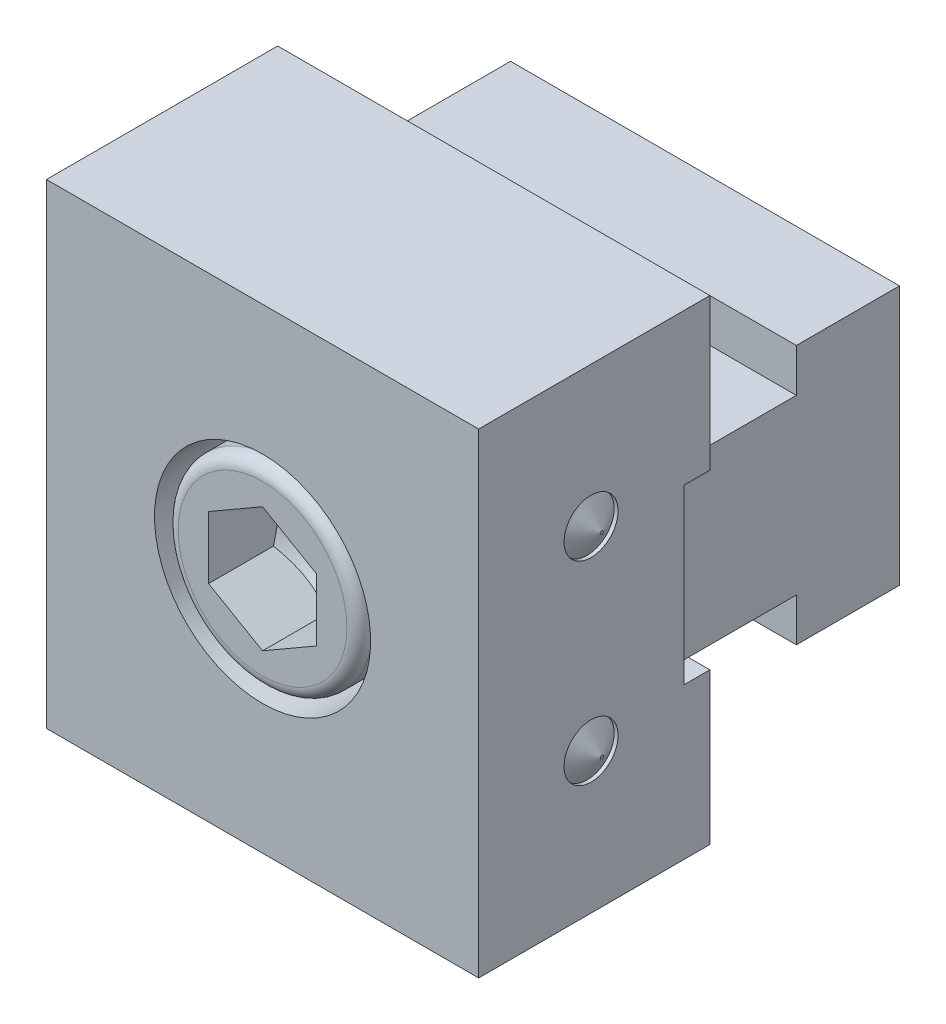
ISO-10303-21;
HEADER;
FILE_DESCRIPTION(('STEP AP214'),'2;1');
FILE_NAME('part.step','',(''),(''),'','','');
FILE_SCHEMA(('AUTOMOTIVE_DESIGN { 1 0 10303 214 1 1 1 1 }'));
ENDSEC;
DATA;
#1=APPLICATION_CONTEXT('core data for automotive mechanical design processes');
#2=APPLICATION_PROTOCOL_DEFINITION('international standard','automotive_design',2000,#1);
#3=PRODUCT_CONTEXT('',#1,'mechanical');
#4=PRODUCT('Part','Part','',(#3));
#5=PRODUCT_RELATED_PRODUCT_CATEGORY('part','',(#4));
#6=PRODUCT_DEFINITION_FORMATION('','',#4);
#7=PRODUCT_DEFINITION_CONTEXT('part definition',#1,'design');
#8=PRODUCT_DEFINITION('design','',#6,#7);
#9=PRODUCT_DEFINITION_SHAPE('','',#8);
#10=(LENGTH_UNIT() NAMED_UNIT(*) SI_UNIT(.MILLI.,.METRE.));
#11=(NAMED_UNIT(*) PLANE_ANGLE_UNIT() SI_UNIT($,.RADIAN.));
#12=(NAMED_UNIT(*) SI_UNIT($,.STERADIAN.) SOLID_ANGLE_UNIT());
#13=UNCERTAINTY_MEASURE_WITH_UNIT(LENGTH_MEASURE(1.E-05),#10,'distance_accuracy_value','');
#14=(GEOMETRIC_REPRESENTATION_CONTEXT(3) GLOBAL_UNCERTAINTY_ASSIGNED_CONTEXT((#13)) GLOBAL_UNIT_ASSIGNED_CONTEXT((#10,
#11,#12)) REPRESENTATION_CONTEXT('',''));
#15=CARTESIAN_POINT('',(0.,0.,0.));
#16=DIRECTION('',(0.,0.,1.));
#17=DIRECTION('',(1.,0.,0.));
#18=AXIS2_PLACEMENT_3D('',#15,#16,#17);
#19=CARTESIAN_POINT('',(0.,0.,-7.7875));
#20=DIRECTION('',(0.,0.,-1.));
#21=DIRECTION('',(-1.,0.,0.));
#22=AXIS2_PLACEMENT_3D('',#19,#20,#21);
#23=CYLINDRICAL_SURFACE('',#22,6.);
#24=CARTESIAN_POINT('',(0.,0.,2.00000000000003));
#25=DIRECTION('',(0.,0.,1.));
#26=DIRECTION('',(0.,-1.,0.));
#27=AXIS2_PLACEMENT_3D('',#24,#25,#26);
#28=CIRCLE('',#27,6.);
#29=CARTESIAN_POINT('',(0.,-6.,2.00000000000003));
#30=VERTEX_POINT('',#29);
#31=EDGE_CURVE('E389',#30,#30,#28,.T.);
#32=ORIENTED_EDGE('',*,*,#31,.T.);
#33=EDGE_LOOP('',(#32));
#34=FACE_BOUND('',#33,.T.);
#35=CARTESIAN_POINT('',(0.,0.,2.4));
#36=DIRECTION('',(0.,0.,1.));
#37=DIRECTION('',(0.,-1.,0.));
#38=AXIS2_PLACEMENT_3D('',#35,#36,#37);
#39=CIRCLE('',#38,6.);
#40=CARTESIAN_POINT('',(0.,-6.,2.4));
#41=VERTEX_POINT('',#40);
#42=EDGE_CURVE('E749',#41,#41,#39,.F.);
#43=ORIENTED_EDGE('',*,*,#42,.T.);
#44=EDGE_LOOP('',(#43));
#45=FACE_BOUND('',#44,.T.);
#46=ADVANCED_FACE('F15',(#34,#45),#23,.T.);
#47=CARTESIAN_POINT('',(-19.6432268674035,-9.,11.));
#48=DIRECTION('',(1.,0.,0.));
#49=DIRECTION('',(0.,1.,0.));
#50=AXIS2_PLACEMENT_3D('',#47,#48,#49);
#51=CONICAL_SURFACE('',#50,2.49999999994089,1.04719755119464);
#52=CARTESIAN_POINT('',(-20.99999999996,-9.,11.));
#53=DIRECTION('',(1.,0.,0.));
#54=DIRECTION('',(0.,1.,0.));
#55=AXIS2_PLACEMENT_3D('',#52,#53,#54);
#56=CIRCLE('',#55,0.15000000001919);
#57=CARTESIAN_POINT('',(-20.99999999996,-8.8499999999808,11.));
#58=VERTEX_POINT('',#57);
#59=EDGE_CURVE('E19',#58,#58,#56,.T.);
#60=CARTESIAN_POINT('',(-19.6432268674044,-9.,11.));
#61=DIRECTION('',(-1.,0.,0.));
#62=DIRECTION('',(0.,-1.,0.));
#63=AXIS2_PLACEMENT_3D('',#60,#61,#62);
#64=CIRCLE('',#63,2.5);
#65=CARTESIAN_POINT('',(-19.6432268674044,-6.50000000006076,11.));
#66=VERTEX_POINT('',#65);
#67=EDGE_CURVE('E9',#66,#66,#64,.F.);
#68=CARTESIAN_POINT('',(-20.99999999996,-8.8499999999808,11.));
#69=CARTESIAN_POINT('',(-20.9858669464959,-8.82552083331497,11.));
#70=CARTESIAN_POINT('',(-20.9717338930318,-8.80104166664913,11.));
#71=CARTESIAN_POINT('',(-20.9434677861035,-8.75208333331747,11.));
#72=CARTESIAN_POINT('',(-20.9293347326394,-8.72760416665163,11.));
#73=CARTESIAN_POINT('',(-20.9010686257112,-8.67864583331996,11.));
#74=CARTESIAN_POINT('',(-20.886935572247,-8.65416666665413,11.));
#75=CARTESIAN_POINT('',(-20.8586694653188,-8.60520833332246,11.));
#76=CARTESIAN_POINT('',(-20.8445364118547,-8.58072916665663,11.));
#77=CARTESIAN_POINT('',(-20.8162703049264,-8.53177083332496,11.));
#78=CARTESIAN_POINT('',(-20.8021372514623,-8.50729166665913,11.));
#79=CARTESIAN_POINT('',(-20.7738711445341,-8.45833333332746,11.));
#80=CARTESIAN_POINT('',(-20.7597380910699,-8.43385416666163,11.));
#81=CARTESIAN_POINT('',(-20.7314719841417,-8.38489583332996,11.));
#82=CARTESIAN_POINT('',(-20.7173389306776,-8.36041666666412,11.));
#83=CARTESIAN_POINT('',(-20.6890728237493,-8.31145833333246,11.));
#84=CARTESIAN_POINT('',(-20.6749397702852,-8.28697916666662,11.));
#85=CARTESIAN_POINT('',(-20.646673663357,-8.23802083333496,11.));
#86=CARTESIAN_POINT('',(-20.6325406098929,-8.21354166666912,11.));
#87=CARTESIAN_POINT('',(-20.6042745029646,-8.16458333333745,11.));
#88=CARTESIAN_POINT('',(-20.5901414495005,-8.14010416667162,11.));
#89=CARTESIAN_POINT('',(-20.5618753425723,-8.09114583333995,11.));
#90=CARTESIAN_POINT('',(-20.5477422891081,-8.06666666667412,11.));
#91=CARTESIAN_POINT('',(-20.5194761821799,-8.01770833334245,11.));
#92=CARTESIAN_POINT('',(-20.5053431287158,-7.99322916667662,11.));
#93=CARTESIAN_POINT('',(-20.4770770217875,-7.94427083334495,11.));
#94=CARTESIAN_POINT('',(-20.4629439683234,-7.91979166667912,11.));
#95=CARTESIAN_POINT('',(-20.4346778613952,-7.87083333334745,11.));
#96=CARTESIAN_POINT('',(-20.420544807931,-7.84635416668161,11.));
#97=CARTESIAN_POINT('',(-20.3922787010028,-7.79739583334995,11.));
#98=CARTESIAN_POINT('',(-20.3781456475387,-7.77291666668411,11.));
#99=CARTESIAN_POINT('',(-20.3498795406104,-7.72395833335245,11.));
#100=CARTESIAN_POINT('',(-20.3357464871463,-7.69947916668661,11.));
#101=CARTESIAN_POINT('',(-20.3074803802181,-7.65052083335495,11.));
#102=CARTESIAN_POINT('',(-20.293347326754,-7.62604166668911,11.));
#103=CARTESIAN_POINT('',(-20.2650812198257,-7.57708333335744,11.));
#104=CARTESIAN_POINT('',(-20.2509481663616,-7.55260416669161,11.));
#105=CARTESIAN_POINT('',(-20.2226820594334,-7.50364583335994,11.));
#106=CARTESIAN_POINT('',(-20.2085490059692,-7.47916666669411,11.));
#107=CARTESIAN_POINT('',(-20.180282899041,-7.43020833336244,11.));
#108=CARTESIAN_POINT('',(-20.1661498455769,-7.40572916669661,11.));
#109=CARTESIAN_POINT('',(-20.1378837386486,-7.35677083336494,11.));
#110=CARTESIAN_POINT('',(-20.1237506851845,-7.33229166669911,11.));
#111=CARTESIAN_POINT('',(-20.0954845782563,-7.28333333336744,11.));
#112=CARTESIAN_POINT('',(-20.0813515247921,-7.2588541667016,11.));
#113=CARTESIAN_POINT('',(-20.0530854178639,-7.20989583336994,11.));
#114=CARTESIAN_POINT('',(-20.0389523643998,-7.1854166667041,11.));
#115=CARTESIAN_POINT('',(-20.0106862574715,-7.13645833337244,11.));
#116=CARTESIAN_POINT('',(-19.9965532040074,-7.1119791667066,11.));
#117=CARTESIAN_POINT('',(-19.9682870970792,-7.06302083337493,11.));
#118=CARTESIAN_POINT('',(-19.9541540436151,-7.0385416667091,11.));
#119=CARTESIAN_POINT('',(-19.9258879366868,-6.98958333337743,11.));
#120=CARTESIAN_POINT('',(-19.9117548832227,-6.9651041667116,11.));
#121=CARTESIAN_POINT('',(-19.8834887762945,-6.91614583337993,11.));
#122=CARTESIAN_POINT('',(-19.8693557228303,-6.8916666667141,11.));
#123=CARTESIAN_POINT('',(-19.8410896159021,-6.84270833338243,11.));
#124=CARTESIAN_POINT('',(-19.826956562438,-6.8182291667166,11.));
#125=CARTESIAN_POINT('',(-19.7986904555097,-6.76927083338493,11.));
#126=CARTESIAN_POINT('',(-19.7845574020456,-6.7447916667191,11.));
#127=CARTESIAN_POINT('',(-19.7562912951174,-6.69583333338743,11.));
#128=CARTESIAN_POINT('',(-19.7421582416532,-6.67135416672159,11.));
#129=CARTESIAN_POINT('',(-19.713892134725,-6.62239583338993,11.));
#130=CARTESIAN_POINT('',(-19.6997590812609,-6.59791666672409,11.));
#131=CARTESIAN_POINT('',(-19.6714929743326,-6.54895833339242,11.));
#132=CARTESIAN_POINT('',(-19.6573599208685,-6.52447916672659,11.));
#133=CARTESIAN_POINT('',(-19.6432268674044,-6.50000000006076,11.));
#134=B_SPLINE_CURVE_WITH_KNOTS('',3,(#68,#69,#70,#71,#72,#73,#74,#75,#76,#77,#78,#79,#80,#81,
#82,#83,#84,#85,#86,#87,#88,#89,#90,#91,#92,#93,#94,#95,#96,#97,#98,#99,#100,#101,#102,#103,
#104,#105,#106,#107,#108,#109,#110,#111,#112,#113,#114,#115,#116,#117,#118,#119,#120,#121,#122,
#123,#124,#125,#126,#127,#128,#129,#130,#131,#132,#133),.UNSPECIFIED.,.F.,.F.,(4,2,2,2,2,2,2,2,
2,2,2,2,2,2,2,2,2,2,2,2,2,2,2,2,2,2,2,2,2,2,2,2,4),(0.,0.0847983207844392,0.169596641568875,
0.254394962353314,0.33919328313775,0.423991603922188,0.508789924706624,0.59358824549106,
0.678386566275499,0.763184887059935,0.847983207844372,0.932781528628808,1.01757984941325,
1.10237817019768,1.18717649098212,1.27197481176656,1.35677313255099,1.44157145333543,
1.52636977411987,1.61116809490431,1.69596641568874,1.78076473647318,1.86556305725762,
1.95036137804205,2.03515969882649,2.11995801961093,2.20475634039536,2.2895546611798,
2.37435298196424,2.45915130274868,2.54394962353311,2.62874794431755,2.71354626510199),.UNSPECIFIED.);
#135=EDGE_CURVE('BSEAM249',#58,#66,#134,.T.);
#136=ORIENTED_EDGE('',*,*,#59,.T.);
#137=ORIENTED_EDGE('',*,*,#67,.F.);
#138=ORIENTED_EDGE('',*,*,#135,.T.);
#139=ORIENTED_EDGE('',*,*,#135,.F.);
#140=EDGE_LOOP('',(#136,#138,#137,#139));
#141=FACE_BOUND('',#140,.T.);
#142=ADVANCED_FACE('F249',(#141),#51,.T.);
#143=CARTESIAN_POINT('',(-21.,-9.,11.));
#144=DIRECTION('',(-1.,0.,0.));
#145=DIRECTION('',(0.,-1.,0.));
#146=AXIS2_PLACEMENT_3D('',#143,#144,#145);
#147=PLANE('',#146);
#148=ORIENTED_EDGE('',*,*,#59,.F.);
#149=EDGE_LOOP('',(#148));
#150=FACE_BOUND('',#149,.T.);
#151=ADVANCED_FACE('F17',(#150),#147,.T.);
#152=CARTESIAN_POINT('',(-19.6432268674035,9.,11.));
#153=DIRECTION('',(1.,0.,0.));
#154=DIRECTION('',(0.,1.,0.));
#155=AXIS2_PLACEMENT_3D('',#152,#153,#154);
#156=CONICAL_SURFACE('',#155,2.49999999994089,1.04719755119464);
#157=CARTESIAN_POINT('',(-20.99999999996,9.,11.));
#158=DIRECTION('',(1.,0.,0.));
#159=DIRECTION('',(0.,1.,0.));
#160=AXIS2_PLACEMENT_3D('',#157,#158,#159);
#161=CIRCLE('',#160,0.15000000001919);
#162=CARTESIAN_POINT('',(-20.99999999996,9.1500000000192,11.));
#163=VERTEX_POINT('',#162);
#164=EDGE_CURVE('E177',#163,#163,#161,.T.);
#165=CARTESIAN_POINT('',(-19.6432268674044,9.,11.));
#166=DIRECTION('',(-1.,0.,0.));
#167=DIRECTION('',(0.,-1.,0.));
#168=AXIS2_PLACEMENT_3D('',#165,#166,#167);
#169=CIRCLE('',#168,2.5);
#170=CARTESIAN_POINT('',(-19.6432268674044,11.4999999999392,11.));
#171=VERTEX_POINT('',#170);
#172=EDGE_CURVE('E26',#171,#171,#169,.F.);
#173=CARTESIAN_POINT('',(-20.99999999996,9.1500000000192,11.));
#174=CARTESIAN_POINT('',(-20.9858669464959,9.17447916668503,11.));
#175=CARTESIAN_POINT('',(-20.9717338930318,9.19895833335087,11.));
#176=CARTESIAN_POINT('',(-20.9434677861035,9.24791666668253,11.));
#177=CARTESIAN_POINT('',(-20.9293347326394,9.27239583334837,11.));
#178=CARTESIAN_POINT('',(-20.9010686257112,9.32135416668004,11.));
#179=CARTESIAN_POINT('',(-20.886935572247,9.34583333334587,11.));
#180=CARTESIAN_POINT('',(-20.8586694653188,9.39479166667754,11.));
#181=CARTESIAN_POINT('',(-20.8445364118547,9.41927083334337,11.));
#182=CARTESIAN_POINT('',(-20.8162703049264,9.46822916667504,11.));
#183=CARTESIAN_POINT('',(-20.8021372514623,9.49270833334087,11.));
#184=CARTESIAN_POINT('',(-20.7738711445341,9.54166666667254,11.));
#185=CARTESIAN_POINT('',(-20.7597380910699,9.56614583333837,11.));
#186=CARTESIAN_POINT('',(-20.7314719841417,9.61510416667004,11.));
#187=CARTESIAN_POINT('',(-20.7173389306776,9.63958333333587,11.));
#188=CARTESIAN_POINT('',(-20.6890728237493,9.68854166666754,11.));
#189=CARTESIAN_POINT('',(-20.6749397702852,9.71302083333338,11.));
#190=CARTESIAN_POINT('',(-20.646673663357,9.76197916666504,11.));
#191=CARTESIAN_POINT('',(-20.6325406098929,9.78645833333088,11.));
#192=CARTESIAN_POINT('',(-20.6042745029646,9.83541666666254,11.));
#193=CARTESIAN_POINT('',(-20.5901414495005,9.85989583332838,11.));
#194=CARTESIAN_POINT('',(-20.5618753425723,9.90885416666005,11.));
#195=CARTESIAN_POINT('',(-20.5477422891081,9.93333333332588,11.));
#196=CARTESIAN_POINT('',(-20.5194761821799,9.98229166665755,11.));
#197=CARTESIAN_POINT('',(-20.5053431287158,10.0067708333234,11.));
#198=CARTESIAN_POINT('',(-20.4770770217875,10.055729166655,11.));
#199=CARTESIAN_POINT('',(-20.4629439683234,10.0802083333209,11.));
#200=CARTESIAN_POINT('',(-20.4346778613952,10.1291666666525,11.));
#201=CARTESIAN_POINT('',(-20.420544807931,10.1536458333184,11.));
#202=CARTESIAN_POINT('',(-20.3922787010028,10.20260416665,11.));
#203=CARTESIAN_POINT('',(-20.3781456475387,10.2270833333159,11.));
#204=CARTESIAN_POINT('',(-20.3498795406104,10.2760416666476,11.));
#205=CARTESIAN_POINT('',(-20.3357464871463,10.3005208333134,11.));
#206=CARTESIAN_POINT('',(-20.3074803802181,10.3494791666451,11.));
#207=CARTESIAN_POINT('',(-20.293347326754,10.3739583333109,11.));
#208=CARTESIAN_POINT('',(-20.2650812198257,10.4229166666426,11.));
#209=CARTESIAN_POINT('',(-20.2509481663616,10.4473958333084,11.));
#210=CARTESIAN_POINT('',(-20.2226820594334,10.4963541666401,11.));
#211=CARTESIAN_POINT('',(-20.2085490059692,10.5208333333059,11.));
#212=CARTESIAN_POINT('',(-20.180282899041,10.5697916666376,11.));
#213=CARTESIAN_POINT('',(-20.1661498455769,10.5942708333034,11.));
#214=CARTESIAN_POINT('',(-20.1378837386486,10.6432291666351,11.));
#215=CARTESIAN_POINT('',(-20.1237506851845,10.6677083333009,11.));
#216=CARTESIAN_POINT('',(-20.0954845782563,10.7166666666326,11.));
#217=CARTESIAN_POINT('',(-20.0813515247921,10.7411458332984,11.));
#218=CARTESIAN_POINT('',(-20.0530854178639,10.7901041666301,11.));
#219=CARTESIAN_POINT('',(-20.0389523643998,10.8145833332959,11.));
#220=CARTESIAN_POINT('',(-20.0106862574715,10.8635416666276,11.));
#221=CARTESIAN_POINT('',(-19.9965532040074,10.8880208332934,11.));
#222=CARTESIAN_POINT('',(-19.9682870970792,10.9369791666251,11.));
#223=CARTESIAN_POINT('',(-19.9541540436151,10.9614583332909,11.));
#224=CARTESIAN_POINT('',(-19.9258879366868,11.0104166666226,11.));
#225=CARTESIAN_POINT('',(-19.9117548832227,11.0348958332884,11.));
#226=CARTESIAN_POINT('',(-19.8834887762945,11.0838541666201,11.));
#227=CARTESIAN_POINT('',(-19.8693557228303,11.1083333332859,11.));
#228=CARTESIAN_POINT('',(-19.8410896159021,11.1572916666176,11.));
#229=CARTESIAN_POINT('',(-19.826956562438,11.1817708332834,11.));
#230=CARTESIAN_POINT('',(-19.7986904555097,11.2307291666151,11.));
#231=CARTESIAN_POINT('',(-19.7845574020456,11.2552083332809,11.));
#232=CARTESIAN_POINT('',(-19.7562912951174,11.3041666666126,11.));
#233=CARTESIAN_POINT('',(-19.7421582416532,11.3286458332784,11.));
#234=CARTESIAN_POINT('',(-19.713892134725,11.3776041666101,11.));
#235=CARTESIAN_POINT('',(-19.6997590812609,11.4020833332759,11.));
#236=CARTESIAN_POINT('',(-19.6714929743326,11.4510416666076,11.));
#237=CARTESIAN_POINT('',(-19.6573599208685,11.4755208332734,11.));
#238=CARTESIAN_POINT('',(-19.6432268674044,11.4999999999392,11.));
#239=B_SPLINE_CURVE_WITH_KNOTS('',3,(#173,#174,#175,#176,#177,#178,#179,#180,#181,#182,#183,
#184,#185,#186,#187,#188,#189,#190,#191,#192,#193,#194,#195,#196,#197,#198,#199,#200,#201,#202,
#203,#204,#205,#206,#207,#208,#209,#210,#211,#212,#213,#214,#215,#216,#217,#218,#219,#220,#221,
#222,#223,#224,#225,#226,#227,#228,#229,#230,#231,#232,#233,#234,#235,#236,#237,#238),
.UNSPECIFIED.,.F.,.F.,(4,2,2,2,2,2,2,2,2,2,2,2,2,2,2,2,2,2,2,2,2,2,2,2,2,2,2,2,2,2,2,2,4),(0.,
0.0847983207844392,0.169596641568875,0.254394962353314,0.33919328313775,0.423991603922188,
0.508789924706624,0.59358824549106,0.678386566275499,0.763184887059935,0.847983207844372,
0.932781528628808,1.01757984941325,1.10237817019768,1.18717649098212,1.27197481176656,
1.35677313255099,1.44157145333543,1.52636977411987,1.61116809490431,1.69596641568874,
1.78076473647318,1.86556305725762,1.95036137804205,2.03515969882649,2.11995801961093,
2.20475634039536,2.2895546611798,2.37435298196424,2.45915130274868,2.54394962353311,
2.62874794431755,2.71354626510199),.UNSPECIFIED.);
#240=EDGE_CURVE('BSEAM373',#163,#171,#239,.T.);
#241=ORIENTED_EDGE('',*,*,#164,.T.);
#242=ORIENTED_EDGE('',*,*,#172,.F.);
#243=ORIENTED_EDGE('',*,*,#240,.T.);
#244=ORIENTED_EDGE('',*,*,#240,.F.);
#245=EDGE_LOOP('',(#241,#243,#242,#244));
#246=FACE_BOUND('',#245,.T.);
#247=ADVANCED_FACE('F373',(#246),#156,.T.);
#248=CARTESIAN_POINT('',(-21.,9.,11.));
#249=DIRECTION('',(-1.,0.,0.));
#250=DIRECTION('',(0.,-1.,0.));
#251=AXIS2_PLACEMENT_3D('',#248,#249,#250);
#252=PLANE('',#251);
#253=ORIENTED_EDGE('',*,*,#164,.F.);
#254=EDGE_LOOP('',(#253));
#255=FACE_BOUND('',#254,.T.);
#256=ADVANCED_FACE('F375',(#255),#252,.T.);
#257=CARTESIAN_POINT('',(19.6432268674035,-9.,11.));
#258=DIRECTION('',(-1.,0.,0.));
#259=DIRECTION('',(0.,-1.,0.));
#260=AXIS2_PLACEMENT_3D('',#257,#258,#259);
#261=CONICAL_SURFACE('',#260,2.49999999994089,1.04719755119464);
#262=CARTESIAN_POINT('',(20.99999999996,-9.,11.));
#263=DIRECTION('',(-1.,0.,0.));
#264=DIRECTION('',(0.,-1.,0.));
#265=AXIS2_PLACEMENT_3D('',#262,#263,#264);
#266=CIRCLE('',#265,0.15000000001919);
#267=CARTESIAN_POINT('',(20.99999999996,-9.1500000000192,11.));
#268=VERTEX_POINT('',#267);
#269=EDGE_CURVE('E748',#268,#268,#266,.T.);
#270=CARTESIAN_POINT('',(19.6432268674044,-9.,11.));
#271=DIRECTION('',(-1.,0.,0.));
#272=DIRECTION('',(0.,-1.,0.));
#273=AXIS2_PLACEMENT_3D('',#270,#271,#272);
#274=CIRCLE('',#273,2.5);
#275=CARTESIAN_POINT('',(19.6432268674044,-11.4999999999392,11.));
#276=VERTEX_POINT('',#275);
#277=EDGE_CURVE('E881',#276,#276,#274,.T.);
#278=CARTESIAN_POINT('',(20.99999999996,-9.1500000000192,11.));
#279=CARTESIAN_POINT('',(20.9858669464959,-9.17447916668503,11.));
#280=CARTESIAN_POINT('',(20.9717338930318,-9.19895833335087,11.));
#281=CARTESIAN_POINT('',(20.9434677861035,-9.24791666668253,11.));
#282=CARTESIAN_POINT('',(20.9293347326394,-9.27239583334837,11.));
#283=CARTESIAN_POINT('',(20.9010686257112,-9.32135416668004,11.));
#284=CARTESIAN_POINT('',(20.886935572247,-9.34583333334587,11.));
#285=CARTESIAN_POINT('',(20.8586694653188,-9.39479166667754,11.));
#286=CARTESIAN_POINT('',(20.8445364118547,-9.41927083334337,11.));
#287=CARTESIAN_POINT('',(20.8162703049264,-9.46822916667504,11.));
#288=CARTESIAN_POINT('',(20.8021372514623,-9.49270833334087,11.));
#289=CARTESIAN_POINT('',(20.7738711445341,-9.54166666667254,11.));
#290=CARTESIAN_POINT('',(20.7597380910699,-9.56614583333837,11.));
#291=CARTESIAN_POINT('',(20.7314719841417,-9.61510416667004,11.));
#292=CARTESIAN_POINT('',(20.7173389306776,-9.63958333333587,11.));
#293=CARTESIAN_POINT('',(20.6890728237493,-9.68854166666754,11.));
#294=CARTESIAN_POINT('',(20.6749397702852,-9.71302083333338,11.));
#295=CARTESIAN_POINT('',(20.646673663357,-9.76197916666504,11.));
#296=CARTESIAN_POINT('',(20.6325406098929,-9.78645833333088,11.));
#297=CARTESIAN_POINT('',(20.6042745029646,-9.83541666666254,11.));
#298=CARTESIAN_POINT('',(20.5901414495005,-9.85989583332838,11.));
#299=CARTESIAN_POINT('',(20.5618753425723,-9.90885416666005,11.));
#300=CARTESIAN_POINT('',(20.5477422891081,-9.93333333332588,11.));
#301=CARTESIAN_POINT('',(20.5194761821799,-9.98229166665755,11.));
#302=CARTESIAN_POINT('',(20.5053431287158,-10.0067708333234,11.));
#303=CARTESIAN_POINT('',(20.4770770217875,-10.055729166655,11.));
#304=CARTESIAN_POINT('',(20.4629439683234,-10.0802083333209,11.));
#305=CARTESIAN_POINT('',(20.4346778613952,-10.1291666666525,11.));
#306=CARTESIAN_POINT('',(20.420544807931,-10.1536458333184,11.));
#307=CARTESIAN_POINT('',(20.3922787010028,-10.20260416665,11.));
#308=CARTESIAN_POINT('',(20.3781456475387,-10.2270833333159,11.));
#309=CARTESIAN_POINT('',(20.3498795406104,-10.2760416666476,11.));
#310=CARTESIAN_POINT('',(20.3357464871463,-10.3005208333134,11.));
#311=CARTESIAN_POINT('',(20.3074803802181,-10.3494791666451,11.));
#312=CARTESIAN_POINT('',(20.293347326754,-10.3739583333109,11.));
#313=CARTESIAN_POINT('',(20.2650812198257,-10.4229166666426,11.));
#314=CARTESIAN_POINT('',(20.2509481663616,-10.4473958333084,11.));
#315=CARTESIAN_POINT('',(20.2226820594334,-10.4963541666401,11.));
#316=CARTESIAN_POINT('',(20.2085490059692,-10.5208333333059,11.));
#317=CARTESIAN_POINT('',(20.180282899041,-10.5697916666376,11.));
#318=CARTESIAN_POINT('',(20.1661498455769,-10.5942708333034,11.));
#319=CARTESIAN_POINT('',(20.1378837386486,-10.6432291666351,11.));
#320=CARTESIAN_POINT('',(20.1237506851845,-10.6677083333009,11.));
#321=CARTESIAN_POINT('',(20.0954845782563,-10.7166666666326,11.));
#322=CARTESIAN_POINT('',(20.0813515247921,-10.7411458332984,11.));
#323=CARTESIAN_POINT('',(20.0530854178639,-10.7901041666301,11.));
#324=CARTESIAN_POINT('',(20.0389523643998,-10.8145833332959,11.));
#325=CARTESIAN_POINT('',(20.0106862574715,-10.8635416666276,11.));
#326=CARTESIAN_POINT('',(19.9965532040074,-10.8880208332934,11.));
#327=CARTESIAN_POINT('',(19.9682870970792,-10.9369791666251,11.));
#328=CARTESIAN_POINT('',(19.9541540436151,-10.9614583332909,11.));
#329=CARTESIAN_POINT('',(19.9258879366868,-11.0104166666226,11.));
#330=CARTESIAN_POINT('',(19.9117548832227,-11.0348958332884,11.));
#331=CARTESIAN_POINT('',(19.8834887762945,-11.0838541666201,11.));
#332=CARTESIAN_POINT('',(19.8693557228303,-11.1083333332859,11.));
#333=CARTESIAN_POINT('',(19.8410896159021,-11.1572916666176,11.));
#334=CARTESIAN_POINT('',(19.826956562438,-11.1817708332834,11.));
#335=CARTESIAN_POINT('',(19.7986904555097,-11.2307291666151,11.));
#336=CARTESIAN_POINT('',(19.7845574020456,-11.2552083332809,11.));
#337=CARTESIAN_POINT('',(19.7562912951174,-11.3041666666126,11.));
#338=CARTESIAN_POINT('',(19.7421582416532,-11.3286458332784,11.));
#339=CARTESIAN_POINT('',(19.713892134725,-11.3776041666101,11.));
#340=CARTESIAN_POINT('',(19.6997590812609,-11.4020833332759,11.));
#341=CARTESIAN_POINT('',(19.6714929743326,-11.4510416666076,11.));
#342=CARTESIAN_POINT('',(19.6573599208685,-11.4755208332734,11.));
#343=CARTESIAN_POINT('',(19.6432268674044,-11.4999999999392,11.));
#344=B_SPLINE_CURVE_WITH_KNOTS('',3,(#278,#279,#280,#281,#282,#283,#284,#285,#286,#287,#288,
#289,#290,#291,#292,#293,#294,#295,#296,#297,#298,#299,#300,#301,#302,#303,#304,#305,#306,#307,
#308,#309,#310,#311,#312,#313,#314,#315,#316,#317,#318,#319,#320,#321,#322,#323,#324,#325,#326,
#327,#328,#329,#330,#331,#332,#333,#334,#335,#336,#337,#338,#339,#340,#341,#342,#343),
.UNSPECIFIED.,.F.,.F.,(4,2,2,2,2,2,2,2,2,2,2,2,2,2,2,2,2,2,2,2,2,2,2,2,2,2,2,2,2,2,2,2,4),(0.,
0.0847983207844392,0.169596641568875,0.254394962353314,0.33919328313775,0.423991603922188,
0.508789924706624,0.59358824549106,0.678386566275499,0.763184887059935,0.847983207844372,
0.932781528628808,1.01757984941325,1.10237817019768,1.18717649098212,1.27197481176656,
1.35677313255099,1.44157145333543,1.52636977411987,1.61116809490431,1.69596641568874,
1.78076473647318,1.86556305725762,1.95036137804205,2.03515969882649,2.11995801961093,
2.20475634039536,2.2895546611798,2.37435298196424,2.45915130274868,2.54394962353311,
2.62874794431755,2.71354626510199),.UNSPECIFIED.);
#345=EDGE_CURVE('BSEAM378',#268,#276,#344,.T.);
#346=ORIENTED_EDGE('',*,*,#269,.T.);
#347=ORIENTED_EDGE('',*,*,#277,.F.);
#348=ORIENTED_EDGE('',*,*,#345,.T.);
#349=ORIENTED_EDGE('',*,*,#345,.F.);
#350=EDGE_LOOP('',(#346,#348,#347,#349));
#351=FACE_BOUND('',#350,.T.);
#352=ADVANCED_FACE('F378',(#351),#261,.T.);
#353=CARTESIAN_POINT('',(21.,-9.,11.));
#354=DIRECTION('',(-1.,0.,0.));
#355=DIRECTION('',(0.,-1.,0.));
#356=AXIS2_PLACEMENT_3D('',#353,#354,#355);
#357=PLANE('',#356);
#358=ORIENTED_EDGE('',*,*,#269,.F.);
#359=EDGE_LOOP('',(#358));
#360=FACE_BOUND('',#359,.T.);
#361=ADVANCED_FACE('F383',(#360),#357,.F.);
#362=CARTESIAN_POINT('',(19.6432268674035,9.,11.));
#363=DIRECTION('',(-1.,0.,0.));
#364=DIRECTION('',(0.,-1.,0.));
#365=AXIS2_PLACEMENT_3D('',#362,#363,#364);
#366=CONICAL_SURFACE('',#365,2.49999999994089,1.04719755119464);
#367=CARTESIAN_POINT('',(20.99999999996,9.,11.));
#368=DIRECTION('',(-1.,0.,0.));
#369=DIRECTION('',(0.,-1.,0.));
#370=AXIS2_PLACEMENT_3D('',#367,#368,#369);
#371=CIRCLE('',#370,0.15000000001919);
#372=CARTESIAN_POINT('',(20.99999999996,8.8499999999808,11.));
#373=VERTEX_POINT('',#372);
#374=EDGE_CURVE('E128',#373,#373,#371,.T.);
#375=CARTESIAN_POINT('',(19.6432268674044,9.,11.));
#376=DIRECTION('',(-1.,0.,0.));
#377=DIRECTION('',(0.,-1.,0.));
#378=AXIS2_PLACEMENT_3D('',#375,#376,#377);
#379=CIRCLE('',#378,2.5);
#380=CARTESIAN_POINT('',(19.6432268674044,6.50000000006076,11.));
#381=VERTEX_POINT('',#380);
#382=EDGE_CURVE('E183',#381,#381,#379,.T.);
#383=CARTESIAN_POINT('',(20.99999999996,8.8499999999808,11.));
#384=CARTESIAN_POINT('',(20.9858669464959,8.82552083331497,11.));
#385=CARTESIAN_POINT('',(20.9717338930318,8.80104166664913,11.));
#386=CARTESIAN_POINT('',(20.9434677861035,8.75208333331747,11.));
#387=CARTESIAN_POINT('',(20.9293347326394,8.72760416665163,11.));
#388=CARTESIAN_POINT('',(20.9010686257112,8.67864583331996,11.));
#389=CARTESIAN_POINT('',(20.886935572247,8.65416666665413,11.));
#390=CARTESIAN_POINT('',(20.8586694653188,8.60520833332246,11.));
#391=CARTESIAN_POINT('',(20.8445364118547,8.58072916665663,11.));
#392=CARTESIAN_POINT('',(20.8162703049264,8.53177083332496,11.));
#393=CARTESIAN_POINT('',(20.8021372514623,8.50729166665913,11.));
#394=CARTESIAN_POINT('',(20.7738711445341,8.45833333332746,11.));
#395=CARTESIAN_POINT('',(20.7597380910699,8.43385416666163,11.));
#396=CARTESIAN_POINT('',(20.7314719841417,8.38489583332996,11.));
#397=CARTESIAN_POINT('',(20.7173389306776,8.36041666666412,11.));
#398=CARTESIAN_POINT('',(20.6890728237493,8.31145833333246,11.));
#399=CARTESIAN_POINT('',(20.6749397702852,8.28697916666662,11.));
#400=CARTESIAN_POINT('',(20.646673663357,8.23802083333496,11.));
#401=CARTESIAN_POINT('',(20.6325406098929,8.21354166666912,11.));
#402=CARTESIAN_POINT('',(20.6042745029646,8.16458333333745,11.));
#403=CARTESIAN_POINT('',(20.5901414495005,8.14010416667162,11.));
#404=CARTESIAN_POINT('',(20.5618753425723,8.09114583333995,11.));
#405=CARTESIAN_POINT('',(20.5477422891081,8.06666666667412,11.));
#406=CARTESIAN_POINT('',(20.5194761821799,8.01770833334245,11.));
#407=CARTESIAN_POINT('',(20.5053431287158,7.99322916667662,11.));
#408=CARTESIAN_POINT('',(20.4770770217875,7.94427083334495,11.));
#409=CARTESIAN_POINT('',(20.4629439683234,7.91979166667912,11.));
#410=CARTESIAN_POINT('',(20.4346778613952,7.87083333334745,11.));
#411=CARTESIAN_POINT('',(20.420544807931,7.84635416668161,11.));
#412=CARTESIAN_POINT('',(20.3922787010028,7.79739583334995,11.));
#413=CARTESIAN_POINT('',(20.3781456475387,7.77291666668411,11.));
#414=CARTESIAN_POINT('',(20.3498795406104,7.72395833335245,11.));
#415=CARTESIAN_POINT('',(20.3357464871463,7.69947916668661,11.));
#416=CARTESIAN_POINT('',(20.3074803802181,7.65052083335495,11.));
#417=CARTESIAN_POINT('',(20.293347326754,7.62604166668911,11.));
#418=CARTESIAN_POINT('',(20.2650812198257,7.57708333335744,11.));
#419=CARTESIAN_POINT('',(20.2509481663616,7.55260416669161,11.));
#420=CARTESIAN_POINT('',(20.2226820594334,7.50364583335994,11.));
#421=CARTESIAN_POINT('',(20.2085490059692,7.47916666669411,11.));
#422=CARTESIAN_POINT('',(20.180282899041,7.43020833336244,11.));
#423=CARTESIAN_POINT('',(20.1661498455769,7.40572916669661,11.));
#424=CARTESIAN_POINT('',(20.1378837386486,7.35677083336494,11.));
#425=CARTESIAN_POINT('',(20.1237506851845,7.33229166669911,11.));
#426=CARTESIAN_POINT('',(20.0954845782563,7.28333333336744,11.));
#427=CARTESIAN_POINT('',(20.0813515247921,7.2588541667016,11.));
#428=CARTESIAN_POINT('',(20.0530854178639,7.20989583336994,11.));
#429=CARTESIAN_POINT('',(20.0389523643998,7.1854166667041,11.));
#430=CARTESIAN_POINT('',(20.0106862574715,7.13645833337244,11.));
#431=CARTESIAN_POINT('',(19.9965532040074,7.1119791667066,11.));
#432=CARTESIAN_POINT('',(19.9682870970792,7.06302083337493,11.));
#433=CARTESIAN_POINT('',(19.9541540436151,7.0385416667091,11.));
#434=CARTESIAN_POINT('',(19.9258879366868,6.98958333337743,11.));
#435=CARTESIAN_POINT('',(19.9117548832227,6.9651041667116,11.));
#436=CARTESIAN_POINT('',(19.8834887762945,6.91614583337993,11.));
#437=CARTESIAN_POINT('',(19.8693557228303,6.8916666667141,11.));
#438=CARTESIAN_POINT('',(19.8410896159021,6.84270833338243,11.));
#439=CARTESIAN_POINT('',(19.826956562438,6.8182291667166,11.));
#440=CARTESIAN_POINT('',(19.7986904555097,6.76927083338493,11.));
#441=CARTESIAN_POINT('',(19.7845574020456,6.7447916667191,11.));
#442=CARTESIAN_POINT('',(19.7562912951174,6.69583333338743,11.));
#443=CARTESIAN_POINT('',(19.7421582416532,6.67135416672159,11.));
#444=CARTESIAN_POINT('',(19.713892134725,6.62239583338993,11.));
#445=CARTESIAN_POINT('',(19.6997590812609,6.59791666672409,11.));
#446=CARTESIAN_POINT('',(19.6714929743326,6.54895833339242,11.));
#447=CARTESIAN_POINT('',(19.6573599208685,6.52447916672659,11.));
#448=CARTESIAN_POINT('',(19.6432268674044,6.50000000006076,11.));
#449=B_SPLINE_CURVE_WITH_KNOTS('',3,(#383,#384,#385,#386,#387,#388,#389,#390,#391,#392,#393,
#394,#395,#396,#397,#398,#399,#400,#401,#402,#403,#404,#405,#406,#407,#408,#409,#410,#411,#412,
#413,#414,#415,#416,#417,#418,#419,#420,#421,#422,#423,#424,#425,#426,#427,#428,#429,#430,#431,
#432,#433,#434,#435,#436,#437,#438,#439,#440,#441,#442,#443,#444,#445,#446,#447,#448),
.UNSPECIFIED.,.F.,.F.,(4,2,2,2,2,2,2,2,2,2,2,2,2,2,2,2,2,2,2,2,2,2,2,2,2,2,2,2,2,2,2,2,4),(0.,
0.0847983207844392,0.169596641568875,0.254394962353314,0.33919328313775,0.423991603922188,
0.508789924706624,0.59358824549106,0.678386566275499,0.763184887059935,0.847983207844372,
0.932781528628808,1.01757984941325,1.10237817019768,1.18717649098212,1.27197481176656,
1.35677313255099,1.44157145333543,1.52636977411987,1.61116809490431,1.69596641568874,
1.78076473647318,1.86556305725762,1.95036137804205,2.03515969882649,2.11995801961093,
2.20475634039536,2.2895546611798,2.37435298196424,2.45915130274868,2.54394962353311,
2.62874794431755,2.71354626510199),.UNSPECIFIED.);
#450=EDGE_CURVE('BSEAM212',#373,#381,#449,.T.);
#451=ORIENTED_EDGE('',*,*,#374,.T.);
#452=ORIENTED_EDGE('',*,*,#382,.F.);
#453=ORIENTED_EDGE('',*,*,#450,.T.);
#454=ORIENTED_EDGE('',*,*,#450,.F.);
#455=EDGE_LOOP('',(#451,#453,#452,#454));
#456=FACE_BOUND('',#455,.T.);
#457=ADVANCED_FACE('F212',(#456),#366,.T.);
#458=CARTESIAN_POINT('',(21.,9.,11.));
#459=DIRECTION('',(-1.,0.,0.));
#460=DIRECTION('',(0.,-1.,0.));
#461=AXIS2_PLACEMENT_3D('',#458,#459,#460);
#462=PLANE('',#461);
#463=ORIENTED_EDGE('',*,*,#374,.F.);
#464=EDGE_LOOP('',(#463));
#465=FACE_BOUND('',#464,.T.);
#466=ADVANCED_FACE('F359',(#465),#462,.F.);
#467=CARTESIAN_POINT('',(-18.,8.,2.00000000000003));
#468=DIRECTION('',(0.,0.,1.));
#469=DIRECTION('',(0.,-1.,0.));
#470=AXIS2_PLACEMENT_3D('',#467,#468,#469);
#471=PLANE('',#470);
#472=ORIENTED_EDGE('',*,*,#31,.F.);
#473=EDGE_LOOP('',(#472));
#474=FACE_BOUND('',#473,.T.);
#475=DIRECTION('',(0.,-1.,0.));
#476=VECTOR('',#475,1.);
#477=CARTESIAN_POINT('',(-18.,5.2846482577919,2.00000000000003));
#478=LINE('',#477,#476);
#479=CARTESIAN_POINT('',(-18.,-8.,2.00000000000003));
#480=VERTEX_POINT('',#479);
#481=CARTESIAN_POINT('',(-18.,8.,2.00000000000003));
#482=VERTEX_POINT('',#481);
#483=EDGE_CURVE('E944',#480,#482,#478,.F.);
#484=ORIENTED_EDGE('',*,*,#483,.F.);
#485=DIRECTION('',(1.,0.,0.));
#486=VECTOR('',#485,1.);
#487=CARTESIAN_POINT('',(-20.,-8.,2.00000000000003));
#488=LINE('',#487,#486);
#489=CARTESIAN_POINT('',(18.,-8.,2.00000000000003));
#490=VERTEX_POINT('',#489);
#491=EDGE_CURVE('E897',#480,#490,#488,.T.);
#492=ORIENTED_EDGE('',*,*,#491,.T.);
#493=DIRECTION('',(0.,-1.,0.));
#494=VECTOR('',#493,1.);
#495=CARTESIAN_POINT('',(18.,5.2846482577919,2.00000000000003));
#496=LINE('',#495,#494);
#497=CARTESIAN_POINT('',(18.,8.,2.00000000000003));
#498=VERTEX_POINT('',#497);
#499=EDGE_CURVE('E973',#498,#490,#496,.T.);
#500=ORIENTED_EDGE('',*,*,#499,.F.);
#501=DIRECTION('',(1.,0.,0.));
#502=VECTOR('',#501,1.);
#503=CARTESIAN_POINT('',(-20.,8.,2.00000000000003));
#504=LINE('',#503,#502);
#505=EDGE_CURVE('E885',#482,#498,#504,.T.);
#506=ORIENTED_EDGE('',*,*,#505,.F.);
#507=EDGE_LOOP('',(#484,#492,#500,#506));
#508=FACE_BOUND('',#507,.T.);
#509=ADVANCED_FACE('F339',(#474,#508),#471,.T.);
#510=CARTESIAN_POINT('',(-18.,8.,-10.));
#511=DIRECTION('',(0.,1.,0.));
#512=DIRECTION('',(0.,0.,1.));
#513=AXIS2_PLACEMENT_3D('',#510,#511,#512);
#514=PLANE('',#513);
#515=DIRECTION('',(1.,0.,0.));
#516=VECTOR('',#515,1.);
#517=CARTESIAN_POINT('',(-20.,8.,0.));
#518=LINE('',#517,#516);
#519=CARTESIAN_POINT('',(-18.,8.,0.));
#520=VERTEX_POINT('',#519);
#521=CARTESIAN_POINT('',(18.,8.,0.));
#522=VERTEX_POINT('',#521);
#523=EDGE_CURVE('E846',#520,#522,#518,.T.);
#524=ORIENTED_EDGE('',*,*,#523,.T.);
#525=DIRECTION('',(0.,0.,1.));
#526=VECTOR('',#525,1.);
#527=CARTESIAN_POINT('',(18.,8.,-9.49031612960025));
#528=LINE('',#527,#526);
#529=CARTESIAN_POINT('',(18.,8.,-10.));
#530=VERTEX_POINT('',#529);
#531=EDGE_CURVE('E977',#530,#522,#528,.T.);
#532=ORIENTED_EDGE('',*,*,#531,.F.);
#533=DIRECTION('',(1.,0.,0.));
#534=VECTOR('',#533,1.);
#535=CARTESIAN_POINT('',(-18.,8.,-10.));
#536=LINE('',#535,#534);
#537=CARTESIAN_POINT('',(-18.,8.,-10.));
#538=VERTEX_POINT('',#537);
#539=EDGE_CURVE('E985',#538,#530,#536,.T.);
#540=ORIENTED_EDGE('',*,*,#539,.F.);
#541=DIRECTION('',(0.,0.,-1.));
#542=VECTOR('',#541,1.);
#543=CARTESIAN_POINT('',(-18.,8.,-9.49031612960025));
#544=LINE('',#543,#542);
#545=EDGE_CURVE('E941',#520,#538,#544,.T.);
#546=ORIENTED_EDGE('',*,*,#545,.F.);
#547=EDGE_LOOP('',(#524,#532,#540,#546));
#548=FACE_BOUND('',#547,.T.);
#549=ADVANCED_FACE('F355',(#548),#514,.T.);
#550=CARTESIAN_POINT('',(18.,5.2846482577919,-9.49031612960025));
#551=DIRECTION('',(1.,0.,0.));
#552=DIRECTION('',(0.,0.,1.));
#553=AXIS2_PLACEMENT_3D('',#550,#551,#552);
#554=PLANE('',#553);
#555=DIRECTION('',(0.,-1.,0.));
#556=VECTOR('',#555,1.);
#557=CARTESIAN_POINT('',(18.,5.2846482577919,-10.));
#558=LINE('',#557,#556);
#559=CARTESIAN_POINT('',(18.,-8.,-10.));
#560=VERTEX_POINT('',#559);
#561=CARTESIAN_POINT('',(18.,-12.,-10.));
#562=VERTEX_POINT('',#561);
#563=EDGE_CURVE('E966',#560,#562,#558,.T.);
#564=ORIENTED_EDGE('',*,*,#563,.T.);
#565=DIRECTION('',(0.,0.,1.));
#566=VECTOR('',#565,1.);
#567=CARTESIAN_POINT('',(18.,-12.,-19.5499287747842));
#568=LINE('',#567,#566);
#569=CARTESIAN_POINT('',(18.,-12.,-19.5499287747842));
#570=VERTEX_POINT('',#569);
#571=EDGE_CURVE('E960',#562,#570,#568,.F.);
#572=ORIENTED_EDGE('',*,*,#571,.T.);
#573=DIRECTION('',(0.,1.,0.));
#574=VECTOR('',#573,1.);
#575=CARTESIAN_POINT('',(18.,0.,-19.5499287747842));
#576=LINE('',#575,#574);
#577=CARTESIAN_POINT('',(18.,12.,-19.5499287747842));
#578=VERTEX_POINT('',#577);
#579=EDGE_CURVE('E922',#578,#570,#576,.F.);
#580=ORIENTED_EDGE('',*,*,#579,.F.);
#581=DIRECTION('',(0.,0.,1.));
#582=VECTOR('',#581,1.);
#583=CARTESIAN_POINT('',(18.,12.,-19.5499287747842));
#584=LINE('',#583,#582);
#585=CARTESIAN_POINT('',(18.,12.,-10.));
#586=VERTEX_POINT('',#585);
#587=EDGE_CURVE('E926',#586,#578,#584,.F.);
#588=ORIENTED_EDGE('',*,*,#587,.F.);
#589=DIRECTION('',(0.,-1.,0.));
#590=VECTOR('',#589,1.);
#591=CARTESIAN_POINT('',(18.,5.2846482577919,-10.));
#592=LINE('',#591,#590);
#593=EDGE_CURVE('E981',#586,#530,#592,.T.);
#594=ORIENTED_EDGE('',*,*,#593,.T.);
#595=ORIENTED_EDGE('',*,*,#531,.T.);
#596=DIRECTION('',(0.,0.,-1.));
#597=VECTOR('',#596,1.);
#598=CARTESIAN_POINT('',(18.,8.,-1.6));
#599=LINE('',#598,#597);
#600=EDGE_CURVE('E893',#498,#522,#599,.T.);
#601=ORIENTED_EDGE('',*,*,#600,.F.);
#602=ORIENTED_EDGE('',*,*,#499,.T.);
#603=DIRECTION('',(0.,0.,1.));
#604=VECTOR('',#603,1.);
#605=CARTESIAN_POINT('',(18.,-8.,-9.49031612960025));
#606=LINE('',#605,#604);
#607=CARTESIAN_POINT('',(18.,-8.,0.));
#608=VERTEX_POINT('',#607);
#609=EDGE_CURVE('E35',#490,#608,#606,.F.);
#610=ORIENTED_EDGE('',*,*,#609,.T.);
#611=EDGE_CURVE('E970',#608,#560,#606,.F.);
#612=ORIENTED_EDGE('',*,*,#611,.T.);
#613=EDGE_LOOP('',(#564,#572,#580,#588,#594,#595,#601,#602,#610,#612));
#614=FACE_BOUND('',#613,.T.);
#615=ADVANCED_FACE('F344',(#614),#554,.T.);
#616=CARTESIAN_POINT('',(-18.,12.,-10.));
#617=DIRECTION('',(0.,0.,1.));
#618=DIRECTION('',(0.,-1.,0.));
#619=AXIS2_PLACEMENT_3D('',#616,#617,#618);
#620=PLANE('',#619);
#621=ORIENTED_EDGE('',*,*,#593,.F.);
#622=DIRECTION('',(1.,0.,0.));
#623=VECTOR('',#622,1.);
#624=CARTESIAN_POINT('',(-18.,12.,-10.));
#625=LINE('',#624,#623);
#626=CARTESIAN_POINT('',(-18.,12.,-10.));
#627=VERTEX_POINT('',#626);
#628=EDGE_CURVE('E930',#627,#586,#625,.T.);
#629=ORIENTED_EDGE('',*,*,#628,.F.);
#630=DIRECTION('',(0.,-1.,0.));
#631=VECTOR('',#630,1.);
#632=CARTESIAN_POINT('',(-18.,5.2846482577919,-10.));
#633=LINE('',#632,#631);
#634=EDGE_CURVE('E938',#538,#627,#633,.F.);
#635=ORIENTED_EDGE('',*,*,#634,.F.);
#636=ORIENTED_EDGE('',*,*,#539,.T.);
#637=EDGE_LOOP('',(#621,#629,#635,#636));
#638=FACE_BOUND('',#637,.T.);
#639=ADVANCED_FACE('F347',(#638),#620,.T.);
#640=CARTESIAN_POINT('',(-18.,5.2846482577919,-9.49031612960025));
#641=DIRECTION('',(-1.,0.,0.));
#642=DIRECTION('',(0.,0.,-1.));
#643=AXIS2_PLACEMENT_3D('',#640,#641,#642);
#644=PLANE('',#643);
#645=ORIENTED_EDGE('',*,*,#634,.T.);
#646=DIRECTION('',(0.,0.,1.));
#647=VECTOR('',#646,1.);
#648=CARTESIAN_POINT('',(-18.,12.,-19.5499287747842));
#649=LINE('',#648,#647);
#650=CARTESIAN_POINT('',(-18.,12.,-19.5499287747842));
#651=VERTEX_POINT('',#650);
#652=EDGE_CURVE('E934',#651,#627,#649,.T.);
#653=ORIENTED_EDGE('',*,*,#652,.F.);
#654=DIRECTION('',(0.,1.,0.));
#655=VECTOR('',#654,1.);
#656=CARTESIAN_POINT('',(-18.,0.,-19.5499287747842));
#657=LINE('',#656,#655);
#658=CARTESIAN_POINT('',(-18.,-12.,-19.5499287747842));
#659=VERTEX_POINT('',#658);
#660=EDGE_CURVE('E914',#659,#651,#657,.T.);
#661=ORIENTED_EDGE('',*,*,#660,.F.);
#662=DIRECTION('',(0.,0.,-1.));
#663=VECTOR('',#662,1.);
#664=CARTESIAN_POINT('',(-18.,-12.,-9.49031612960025));
#665=LINE('',#664,#663);
#666=CARTESIAN_POINT('',(-18.,-12.,-10.));
#667=VERTEX_POINT('',#666);
#668=EDGE_CURVE('E956',#659,#667,#665,.F.);
#669=ORIENTED_EDGE('',*,*,#668,.T.);
#670=DIRECTION('',(0.,-1.,0.));
#671=VECTOR('',#670,1.);
#672=CARTESIAN_POINT('',(-18.,5.2846482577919,-10.));
#673=LINE('',#672,#671);
#674=CARTESIAN_POINT('',(-18.,-8.,-10.));
#675=VERTEX_POINT('',#674);
#676=EDGE_CURVE('E952',#667,#675,#673,.F.);
#677=ORIENTED_EDGE('',*,*,#676,.T.);
#678=DIRECTION('',(0.,0.,-1.));
#679=VECTOR('',#678,1.);
#680=CARTESIAN_POINT('',(-18.,-8.,-9.49031612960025));
#681=LINE('',#680,#679);
#682=CARTESIAN_POINT('',(-18.,-8.,0.));
#683=VERTEX_POINT('',#682);
#684=EDGE_CURVE('E948',#675,#683,#681,.F.);
#685=ORIENTED_EDGE('',*,*,#684,.T.);
#686=DIRECTION('',(0.,0.,1.));
#687=VECTOR('',#686,1.);
#688=CARTESIAN_POINT('',(-18.,-8.,-1.6));
#689=LINE('',#688,#687);
#690=EDGE_CURVE('E900',#683,#480,#689,.T.);
#691=ORIENTED_EDGE('',*,*,#690,.T.);
#692=ORIENTED_EDGE('',*,*,#483,.T.);
#693=DIRECTION('',(0.,0.,1.));
#694=VECTOR('',#693,1.);
#695=CARTESIAN_POINT('',(-18.,8.,-1.6));
#696=LINE('',#695,#694);
#697=EDGE_CURVE('E889',#520,#482,#696,.T.);
#698=ORIENTED_EDGE('',*,*,#697,.F.);
#699=ORIENTED_EDGE('',*,*,#545,.T.);
#700=EDGE_LOOP('',(#645,#653,#661,#669,#677,#685,#691,#692,#698,#699));
#701=FACE_BOUND('',#700,.T.);
#702=ADVANCED_FACE('F342',(#701),#644,.T.);
#703=CARTESIAN_POINT('',(-18.,12.,-19.5499287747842));
#704=DIRECTION('',(0.,1.,0.));
#705=DIRECTION('',(0.,0.,1.));
#706=AXIS2_PLACEMENT_3D('',#703,#704,#705);
#707=PLANE('',#706);
#708=ORIENTED_EDGE('',*,*,#587,.T.);
#709=DIRECTION('',(1.,0.,0.));
#710=VECTOR('',#709,1.);
#711=CARTESIAN_POINT('',(-18.,12.,-19.5499287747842));
#712=LINE('',#711,#710);
#713=EDGE_CURVE('E910',#651,#578,#712,.T.);
#714=ORIENTED_EDGE('',*,*,#713,.F.);
#715=ORIENTED_EDGE('',*,*,#652,.T.);
#716=ORIENTED_EDGE('',*,*,#628,.T.);
#717=EDGE_LOOP('',(#708,#714,#715,#716));
#718=FACE_BOUND('',#717,.T.);
#719=ADVANCED_FACE('F337',(#718),#707,.T.);
#720=CARTESIAN_POINT('',(-18.,0.,-19.5499287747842));
#721=DIRECTION('',(0.,0.,-1.));
#722=DIRECTION('',(0.,1.,0.));
#723=AXIS2_PLACEMENT_3D('',#720,#721,#722);
#724=PLANE('',#723);
#725=CARTESIAN_POINT('',(0.,0.,-19.5499287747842));
#726=DIRECTION('',(0.,0.,1.));
#727=DIRECTION('',(0.,-1.,0.));
#728=AXIS2_PLACEMENT_3D('',#725,#726,#727);
#729=CIRCLE('',#728,6.);
#730=CARTESIAN_POINT('',(0.,-6.,-19.5499287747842));
#731=VERTEX_POINT('',#730);
#732=EDGE_CURVE('E392',#731,#731,#729,.T.);
#733=ORIENTED_EDGE('',*,*,#732,.T.);
#734=EDGE_LOOP('',(#733));
#735=FACE_BOUND('',#734,.T.);
#736=ORIENTED_EDGE('',*,*,#660,.T.);
#737=ORIENTED_EDGE('',*,*,#713,.T.);
#738=ORIENTED_EDGE('',*,*,#579,.T.);
#739=DIRECTION('',(1.,0.,0.));
#740=VECTOR('',#739,1.);
#741=CARTESIAN_POINT('',(-18.,-12.,-19.5499287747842));
#742=LINE('',#741,#740);
#743=EDGE_CURVE('E918',#570,#659,#742,.F.);
#744=ORIENTED_EDGE('',*,*,#743,.T.);
#745=EDGE_LOOP('',(#736,#737,#738,#744));
#746=FACE_BOUND('',#745,.T.);
#747=ADVANCED_FACE('F333',(#735,#746),#724,.T.);
#748=CARTESIAN_POINT('',(-18.,-12.,-19.5499287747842));
#749=DIRECTION('',(0.,1.,0.));
#750=DIRECTION('',(0.,0.,1.));
#751=AXIS2_PLACEMENT_3D('',#748,#749,#750);
#752=PLANE('',#751);
#753=ORIENTED_EDGE('',*,*,#743,.F.);
#754=ORIENTED_EDGE('',*,*,#571,.F.);
#755=DIRECTION('',(1.,0.,0.));
#756=VECTOR('',#755,1.);
#757=CARTESIAN_POINT('',(-18.,-12.,-10.));
#758=LINE('',#757,#756);
#759=EDGE_CURVE('E963',#667,#562,#758,.T.);
#760=ORIENTED_EDGE('',*,*,#759,.F.);
#761=ORIENTED_EDGE('',*,*,#668,.F.);
#762=EDGE_LOOP('',(#753,#754,#760,#761));
#763=FACE_BOUND('',#762,.T.);
#764=ADVANCED_FACE('F336',(#763),#752,.F.);
#765=CARTESIAN_POINT('',(-18.,-12.,-10.));
#766=DIRECTION('',(0.,0.,-1.));
#767=DIRECTION('',(0.,1.,0.));
#768=AXIS2_PLACEMENT_3D('',#765,#766,#767);
#769=PLANE('',#768);
#770=ORIENTED_EDGE('',*,*,#759,.T.);
#771=ORIENTED_EDGE('',*,*,#563,.F.);
#772=DIRECTION('',(1.,0.,0.));
#773=VECTOR('',#772,1.);
#774=CARTESIAN_POINT('',(-18.,-8.,-10.));
#775=LINE('',#774,#773);
#776=EDGE_CURVE('E908',#560,#675,#775,.F.);
#777=ORIENTED_EDGE('',*,*,#776,.T.);
#778=ORIENTED_EDGE('',*,*,#676,.F.);
#779=EDGE_LOOP('',(#770,#771,#777,#778));
#780=FACE_BOUND('',#779,.T.);
#781=ADVANCED_FACE('F351',(#780),#769,.F.);
#782=CARTESIAN_POINT('',(-18.,-8.,-10.));
#783=DIRECTION('',(0.,1.,0.));
#784=DIRECTION('',(0.,0.,1.));
#785=AXIS2_PLACEMENT_3D('',#782,#783,#784);
#786=PLANE('',#785);
#787=ORIENTED_EDGE('',*,*,#611,.F.);
#788=DIRECTION('',(1.,0.,0.));
#789=VECTOR('',#788,1.);
#790=CARTESIAN_POINT('',(-20.,-8.,0.));
#791=LINE('',#790,#789);
#792=EDGE_CURVE('E859',#608,#683,#791,.F.);
#793=ORIENTED_EDGE('',*,*,#792,.T.);
#794=ORIENTED_EDGE('',*,*,#684,.F.);
#795=ORIENTED_EDGE('',*,*,#776,.F.);
#796=EDGE_LOOP('',(#787,#793,#794,#795));
#797=FACE_BOUND('',#796,.T.);
#798=ADVANCED_FACE('F331',(#797),#786,.F.);
#799=CARTESIAN_POINT('',(0.,0.,-19.5499287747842));
#800=DIRECTION('',(0.,0.,1.));
#801=DIRECTION('',(0.,-1.,0.));
#802=AXIS2_PLACEMENT_3D('',#799,#800,#801);
#803=CYLINDRICAL_SURFACE('',#802,6.);
#804=CARTESIAN_POINT('',(0.,0.,-19.5264625));
#805=DIRECTION('',(0.,0.,-1.));
#806=DIRECTION('',(-1.,0.,0.));
#807=AXIS2_PLACEMENT_3D('',#804,#805,#806);
#808=CIRCLE('',#807,6.);
#809=CARTESIAN_POINT('',(-6.,0.,-19.5264625));
#810=VERTEX_POINT('',#809);
#811=EDGE_CURVE('E396',#810,#810,#808,.F.);
#812=ORIENTED_EDGE('',*,*,#811,.T.);
#813=EDGE_LOOP('',(#812));
#814=FACE_BOUND('',#813,.T.);
#815=ORIENTED_EDGE('',*,*,#732,.F.);
#816=EDGE_LOOP('',(#815));
#817=FACE_BOUND('',#816,.T.);
#818=ADVANCED_FACE('F327',(#814,#817),#803,.F.);
#819=CARTESIAN_POINT('',(0.,0.,-19.526462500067));
#820=DIRECTION('',(0.,0.,1.));
#821=DIRECTION('',(0.,1.,0.));
#822=AXIS2_PLACEMENT_3D('',#819,#820,#821);
#823=CONICAL_SURFACE('',#822,5.99999999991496,0.785398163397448);
#824=CARTESIAN_POINT('',(0.,0.,-20.6000000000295));
#825=DIRECTION('',(0.,0.,1.));
#826=DIRECTION('',(0.,1.,0.));
#827=AXIS2_PLACEMENT_3D('',#824,#825,#826);
#828=CIRCLE('',#827,4.92646249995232);
#829=CARTESIAN_POINT('',(0.,4.92646249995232,-20.6000000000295));
#830=VERTEX_POINT('',#829);
#831=EDGE_CURVE('E173',#830,#830,#828,.T.);
#832=ORIENTED_EDGE('',*,*,#831,.T.);
#833=EDGE_LOOP('',(#832));
#834=FACE_BOUND('',#833,.T.);
#835=ORIENTED_EDGE('',*,*,#811,.F.);
#836=EDGE_LOOP('',(#835));
#837=FACE_BOUND('',#836,.T.);
#838=ADVANCED_FACE('F330',(#834,#837),#823,.T.);
#839=CARTESIAN_POINT('',(-3.,0.,-20.6));
#840=DIRECTION('',(0.,0.,-1.));
#841=DIRECTION('',(-1.,0.,0.));
#842=AXIS2_PLACEMENT_3D('',#839,#840,#841);
#843=PLANE('',#842);
#844=ORIENTED_EDGE('',*,*,#831,.F.);
#845=EDGE_LOOP('',(#844));
#846=FACE_BOUND('',#845,.T.);
#847=ADVANCED_FACE('F619',(#846),#843,.T.);
#848=CARTESIAN_POINT('',(0.,0.,15.4));
#849=DIRECTION('',(0.,0.,-1.));
#850=DIRECTION('',(-1.,0.,0.));
#851=AXIS2_PLACEMENT_3D('',#848,#849,#850);
#852=CYLINDRICAL_SURFACE('',#851,9.);
#853=CARTESIAN_POINT('',(0.,0.,20.2));
#854=DIRECTION('',(0.,0.,-1.));
#855=DIRECTION('',(-1.,0.,0.));
#856=AXIS2_PLACEMENT_3D('',#853,#854,#855);
#857=CIRCLE('',#856,9.);
#858=CARTESIAN_POINT('',(-8.99999999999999,0.,20.2));
#859=VERTEX_POINT('',#858);
#860=EDGE_CURVE('E178',#859,#859,#857,.T.);
#861=ORIENTED_EDGE('',*,*,#860,.T.);
#862=EDGE_LOOP('',(#861));
#863=FACE_BOUND('',#862,.T.);
#864=CARTESIAN_POINT('',(0.,0.,9.4));
#865=DIRECTION('',(0.,0.,-1.));
#866=DIRECTION('',(-1.,0.,0.));
#867=AXIS2_PLACEMENT_3D('',#864,#865,#866);
#868=CIRCLE('',#867,9.);
#869=CARTESIAN_POINT('',(-8.99999999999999,0.,9.4));
#870=VERTEX_POINT('',#869);
#871=EDGE_CURVE('E179',#870,#870,#868,.T.);
#872=ORIENTED_EDGE('',*,*,#871,.F.);
#873=EDGE_LOOP('',(#872));
#874=FACE_BOUND('',#873,.T.);
#875=ADVANCED_FACE('F413',(#863,#874),#852,.T.);
#876=CARTESIAN_POINT('',(0.,0.,20.2));
#877=DIRECTION('',(0.,0.,-1.));
#878=DIRECTION('',(0.,-1.,0.));
#879=AXIS2_PLACEMENT_3D('',#876,#877,#878);
#880=TOROIDAL_SURFACE('',#879,7.8,1.2);
#881=ORIENTED_EDGE('',*,*,#860,.F.);
#882=EDGE_LOOP('',(#881));
#883=FACE_BOUND('',#882,.T.);
#884=CARTESIAN_POINT('',(0.,0.,21.4));
#885=DIRECTION('',(0.,0.,-1.));
#886=DIRECTION('',(-1.,0.,0.));
#887=AXIS2_PLACEMENT_3D('',#884,#885,#886);
#888=CIRCLE('',#887,7.8);
#889=CARTESIAN_POINT('',(-7.8,0.,21.4));
#890=VERTEX_POINT('',#889);
#891=EDGE_CURVE('E158',#890,#890,#888,.T.);
#892=ORIENTED_EDGE('',*,*,#891,.T.);
#893=EDGE_LOOP('',(#892));
#894=FACE_BOUND('',#893,.T.);
#895=ADVANCED_FACE('F408',(#883,#894),#880,.T.);
#896=CARTESIAN_POINT('',(-7.38675134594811,0.,21.4));
#897=DIRECTION('',(0.,0.,1.));
#898=DIRECTION('',(1.,0.,0.));
#899=AXIS2_PLACEMENT_3D('',#896,#897,#898);
#900=PLANE('',#899);
#901=DIRECTION('',(-0.86602540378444,-0.5,0.));
#902=VECTOR('',#901,1.);
#903=CARTESIAN_POINT('',(5.,-2.88675134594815,21.4));
#904=LINE('',#903,#902);
#905=CARTESIAN_POINT('',(5.,-2.88675134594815,21.4));
#906=VERTEX_POINT('',#905);
#907=CARTESIAN_POINT('',(0.,-5.77350269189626,21.4));
#908=VERTEX_POINT('',#907);
#909=EDGE_CURVE('E159',#906,#908,#904,.T.);
#910=ORIENTED_EDGE('',*,*,#909,.T.);
#911=DIRECTION('',(-0.866025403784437,0.5,0.));
#912=VECTOR('',#911,1.);
#913=CARTESIAN_POINT('',(0.,-5.77350269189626,21.4));
#914=LINE('',#913,#912);
#915=CARTESIAN_POINT('',(-5.,-2.88675134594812,21.4));
#916=VERTEX_POINT('',#915);
#917=EDGE_CURVE('E154',#908,#916,#914,.T.);
#918=ORIENTED_EDGE('',*,*,#917,.T.);
#919=DIRECTION('',(0.,1.,0.));
#920=VECTOR('',#919,1.);
#921=CARTESIAN_POINT('',(-5.,0.,21.4));
#922=LINE('',#921,#920);
#923=CARTESIAN_POINT('',(-5.,2.88675134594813,21.4));
#924=VERTEX_POINT('',#923);
#925=EDGE_CURVE('E150',#916,#924,#922,.T.);
#926=ORIENTED_EDGE('',*,*,#925,.T.);
#927=DIRECTION('',(0.866025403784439,0.5,0.));
#928=VECTOR('',#927,1.);
#929=CARTESIAN_POINT('',(-5.,2.88675134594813,21.4));
#930=LINE('',#929,#928);
#931=CARTESIAN_POINT('',(0.,5.77350269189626,21.4));
#932=VERTEX_POINT('',#931);
#933=EDGE_CURVE('E142',#924,#932,#930,.T.);
#934=ORIENTED_EDGE('',*,*,#933,.T.);
#935=DIRECTION('',(0.866025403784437,-0.5,0.));
#936=VECTOR('',#935,1.);
#937=CARTESIAN_POINT('',(0.,5.77350269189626,21.4));
#938=LINE('',#937,#936);
#939=CARTESIAN_POINT('',(5.,2.88675134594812,21.4));
#940=VERTEX_POINT('',#939);
#941=EDGE_CURVE('E167',#932,#940,#938,.T.);
#942=ORIENTED_EDGE('',*,*,#941,.T.);
#943=DIRECTION('',(0.,1.,0.));
#944=VECTOR('',#943,1.);
#945=CARTESIAN_POINT('',(5.,0.,21.4));
#946=LINE('',#945,#944);
#947=EDGE_CURVE('E163',#940,#906,#946,.F.);
#948=ORIENTED_EDGE('',*,*,#947,.T.);
#949=EDGE_LOOP('',(#910,#918,#926,#934,#942,#948));
#950=FACE_BOUND('',#949,.T.);
#951=ORIENTED_EDGE('',*,*,#891,.F.);
#952=EDGE_LOOP('',(#951));
#953=FACE_BOUND('',#952,.T.);
#954=ADVANCED_FACE('F412',(#950,#953),#900,.T.);
#955=CARTESIAN_POINT('',(0.,-5.77350269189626,21.4));
#956=DIRECTION('',(0.5,-0.86602540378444,0.));
#957=DIRECTION('',(-0.86602540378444,-0.5,0.));
#958=AXIS2_PLACEMENT_3D('',#955,#956,#957);
#959=PLANE('',#958);
#960=DIRECTION('',(0.,0.,-1.));
#961=VECTOR('',#960,1.);
#962=CARTESIAN_POINT('',(0.,-5.77350269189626,21.4));
#963=LINE('',#962,#961);
#964=CARTESIAN_POINT('',(0.,-5.77350269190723,15.399999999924));
#965=VERTEX_POINT('',#964);
#966=EDGE_CURVE('E430',#965,#908,#963,.F.);
#967=ORIENTED_EDGE('',*,*,#966,.T.);
#968=ORIENTED_EDGE('',*,*,#909,.F.);
#969=DIRECTION('',(0.,0.,-1.));
#970=VECTOR('',#969,1.);
#971=CARTESIAN_POINT('',(5.,-2.88675134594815,21.4));
#972=LINE('',#971,#970);
#973=CARTESIAN_POINT('',(5.0000000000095,-2.88675134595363,15.399999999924));
#974=VERTEX_POINT('',#973);
#975=EDGE_CURVE('E433',#974,#906,#972,.F.);
#976=ORIENTED_EDGE('',*,*,#975,.F.);
#977=CARTESIAN_POINT('',(-2.430998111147E-11,-5.77350269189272,15.3999999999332));
#978=CARTESIAN_POINT('',(0.219731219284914,-5.64664081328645,15.3267433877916));
#979=CARTESIAN_POINT('',(0.441341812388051,-5.51869387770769,15.2601139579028));
#980=CARTESIAN_POINT('',(0.888400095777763,-5.26058465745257,15.1438136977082));
#981=CARTESIAN_POINT('',(1.11385572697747,-5.13041778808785,15.0941840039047));
#982=CARTESIAN_POINT('',(1.56200735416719,-4.87167732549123,15.0169443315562));
#983=CARTESIAN_POINT('',(1.78463357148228,-4.74314401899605,14.9888198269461));
#984=CARTESIAN_POINT('',(2.11935570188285,-4.54989210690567,14.9636032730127));
#985=CARTESIAN_POINT('',(2.23100606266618,-4.48543074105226,14.9580247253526));
#986=CARTESIAN_POINT('',(2.45440985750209,-4.35644849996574,14.9526191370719));
#987=CARTESIAN_POINT('',(2.5661632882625,-4.29192762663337,14.9527919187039));
#988=CARTESIAN_POINT('',(2.87231037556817,-4.11517352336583,14.9611797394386));
#989=CARTESIAN_POINT('',(3.06660250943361,-4.00299890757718,14.975256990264));
#990=CARTESIAN_POINT('',(3.45389732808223,-3.77939413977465,15.0198894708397));
#991=CARTESIAN_POINT('',(3.64689865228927,-3.66796477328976,15.0504599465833));
#992=CARTESIAN_POINT('',(4.03497329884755,-3.44390977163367,15.1268756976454));
#993=CARTESIAN_POINT('',(4.22999766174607,-3.33131240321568,15.1730446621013));
#994=CARTESIAN_POINT('',(4.61713844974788,-3.10779656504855,15.2778288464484));
#995=CARTESIAN_POINT('',(4.80925983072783,-2.99687523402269,15.3364194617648));
#996=CARTESIAN_POINT('',(5.0000000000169,-2.88675134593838,15.3999999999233));
#997=B_SPLINE_CURVE_WITH_KNOTS('',3,(#977,#978,#979,#980,#981,#982,#983,#984,#985,#986,#987,
#988,#989,#990,#991,#992,#993,#994,#995,#996),.UNSPECIFIED.,.F.,.F.,(4,2,2,2,2,2,2,2,2,4),(0.,
0.792540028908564,1.58698454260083,2.3617690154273,2.74878733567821,3.13579369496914,
3.80946092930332,4.48375195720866,5.17299552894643,5.86088640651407),.UNSPECIFIED.);
#998=EDGE_CURVE('E193',#965,#974,#997,.T.);
#999=ORIENTED_EDGE('',*,*,#998,.F.);
#1000=EDGE_LOOP('',(#967,#968,#976,#999));
#1001=FACE_BOUND('',#1000,.T.);
#1002=ADVANCED_FACE('F453',(#1001),#959,.F.);
#1003=CARTESIAN_POINT('',(-5.,-2.88675134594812,21.4));
#1004=DIRECTION('',(-0.5,-0.866025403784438,0.));
#1005=DIRECTION('',(-0.866025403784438,0.5,0.));
#1006=AXIS2_PLACEMENT_3D('',#1003,#1004,#1005);
#1007=PLANE('',#1006);
#1008=DIRECTION('',(0.,0.,-1.));
#1009=VECTOR('',#1008,1.);
#1010=CARTESIAN_POINT('',(-5.,-2.88675134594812,21.4));
#1011=LINE('',#1010,#1009);
#1012=CARTESIAN_POINT('',(-5.,-2.88675134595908,15.3999999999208));
#1013=VERTEX_POINT('',#1012);
#1014=EDGE_CURVE('E123',#916,#1013,#1011,.T.);
#1015=ORIENTED_EDGE('',*,*,#1014,.F.);
#1016=ORIENTED_EDGE('',*,*,#917,.F.);
#1017=ORIENTED_EDGE('',*,*,#966,.F.);
#1018=CARTESIAN_POINT('',(-5.0000000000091,-2.8867513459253,15.3999999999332));
#1019=CARTESIAN_POINT('',(-4.78026878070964,-3.01361322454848,15.3267433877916));
#1020=CARTESIAN_POINT('',(-4.55865818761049,-3.14156016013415,15.2601139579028));
#1021=CARTESIAN_POINT('',(-4.1115999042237,-3.39966938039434,15.1438136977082));
#1022=CARTESIAN_POINT('',(-3.88614427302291,-3.52983624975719,15.0941840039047));
#1023=CARTESIAN_POINT('',(-3.43799264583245,-3.78857671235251,15.0169443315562));
#1024=CARTESIAN_POINT('',(-3.21536642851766,-3.91711001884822,14.9888198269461));
#1025=CARTESIAN_POINT('',(-2.88064429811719,-4.11036193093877,14.9636032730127));
#1026=CARTESIAN_POINT('',(-2.76899393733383,-4.17482329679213,14.9580247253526));
#1027=CARTESIAN_POINT('',(-2.5455901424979,-4.30380553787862,14.9526191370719));
#1028=CARTESIAN_POINT('',(-2.4338367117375,-4.36832641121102,14.9527919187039));
#1029=CARTESIAN_POINT('',(-2.12768962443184,-4.54508051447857,14.9611797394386));
#1030=CARTESIAN_POINT('',(-1.93339749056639,-4.6572551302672,14.975256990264));
#1031=CARTESIAN_POINT('',(-1.54610267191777,-4.88085989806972,15.0198894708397));
#1032=CARTESIAN_POINT('',(-1.35310134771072,-4.99228926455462,15.0504599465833));
#1033=CARTESIAN_POINT('',(-0.965026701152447,-5.21634426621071,15.1268756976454));
#1034=CARTESIAN_POINT('',(-0.770002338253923,-5.32894163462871,15.1730446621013));
#1035=CARTESIAN_POINT('',(-0.382861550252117,-5.55245747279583,15.2778288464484));
#1036=CARTESIAN_POINT('',(-0.190740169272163,-5.6633788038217,15.3364194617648));
#1037=CARTESIAN_POINT('',(1.68949056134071E-11,-5.77350269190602,15.3999999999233));
#1038=B_SPLINE_CURVE_WITH_KNOTS('',3,(#1018,#1019,#1020,#1021,#1022,#1023,#1024,#1025,#1026,
#1027,#1028,#1029,#1030,#1031,#1032,#1033,#1034,#1035,#1036,#1037),.UNSPECIFIED.,.F.,.F.,(4,2,2,
2,2,2,2,2,2,4),(0.,0.792540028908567,1.58698454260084,2.3617690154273,2.74878733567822,
3.13579369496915,3.80946092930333,4.48375195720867,5.17299552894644,5.86088640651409),.UNSPECIFIED.);
#1039=EDGE_CURVE('E153',#1013,#965,#1038,.T.);
#1040=ORIENTED_EDGE('',*,*,#1039,.F.);
#1041=EDGE_LOOP('',(#1015,#1016,#1017,#1040));
#1042=FACE_BOUND('',#1041,.T.);
#1043=ADVANCED_FACE('F200',(#1042),#1007,.F.);
#1044=CARTESIAN_POINT('',(-5.,2.88675134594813,21.4));
#1045=DIRECTION('',(-1.,0.,0.));
#1046=DIRECTION('',(0.,1.,0.));
#1047=AXIS2_PLACEMENT_3D('',#1044,#1045,#1046);
#1048=PLANE('',#1047);
#1049=DIRECTION('',(0.,0.,-1.));
#1050=VECTOR('',#1049,1.);
#1051=CARTESIAN_POINT('',(-5.,2.88675134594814,21.4));
#1052=LINE('',#1051,#1050);
#1053=CARTESIAN_POINT('',(-5.00000000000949,2.88675134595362,15.399999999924));
#1054=VERTEX_POINT('',#1053);
#1055=EDGE_CURVE('E120',#1054,#924,#1052,.F.);
#1056=ORIENTED_EDGE('',*,*,#1055,.T.);
#1057=ORIENTED_EDGE('',*,*,#925,.F.);
#1058=ORIENTED_EDGE('',*,*,#1014,.T.);
#1059=CARTESIAN_POINT('',(-4.99999999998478,2.88675134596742,15.3999999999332));
#1060=CARTESIAN_POINT('',(-4.99999999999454,2.63302758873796,15.3267433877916));
#1061=CARTESIAN_POINT('',(-4.99999999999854,2.37713371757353,15.2601139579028));
#1062=CARTESIAN_POINT('',(-5.00000000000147,1.86091527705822,15.1438136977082));
#1063=CARTESIAN_POINT('',(-5.00000000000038,1.60058153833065,15.0941840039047));
#1064=CARTESIAN_POINT('',(-4.99999999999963,1.08310061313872,15.0169443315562));
#1065=CARTESIAN_POINT('',(-4.99999999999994,0.826034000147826,14.9888198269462));
#1066=CARTESIAN_POINT('',(-5.00000000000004,0.439530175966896,14.9636032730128));
#1067=CARTESIAN_POINT('',(-5.00000000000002,0.310607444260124,14.9580247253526));
#1068=CARTESIAN_POINT('',(-4.99999999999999,0.052642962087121,14.9526191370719));
#1069=CARTESIAN_POINT('',(-5.,-0.0763987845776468,14.9527919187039));
#1070=CARTESIAN_POINT('',(-5.,-0.429906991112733,14.9611797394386));
#1071=CARTESIAN_POINT('',(-5.00000000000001,-0.654256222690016,14.975256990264));
#1072=CARTESIAN_POINT('',(-5.00000000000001,-1.10146575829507,15.0198894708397));
#1073=CARTESIAN_POINT('',(-5.00000000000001,-1.32432449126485,15.0504599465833));
#1074=CARTESIAN_POINT('',(-5.00000000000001,-1.77243449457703,15.1268756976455));
#1075=CARTESIAN_POINT('',(-5.00000000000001,-1.99762923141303,15.1730446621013));
#1076=CARTESIAN_POINT('',(-5.00000000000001,-2.44466090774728,15.2778288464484));
#1077=CARTESIAN_POINT('',(-5.00000000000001,-2.666503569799,15.3364194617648));
#1078=CARTESIAN_POINT('',(-5.,-2.88675134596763,15.3999999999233));
#1079=B_SPLINE_CURVE_WITH_KNOTS('',3,(#1059,#1060,#1061,#1062,#1063,#1064,#1065,#1066,#1067,
#1068,#1069,#1070,#1071,#1072,#1073,#1074,#1075,#1076,#1077,#1078),.UNSPECIFIED.,.F.,.F.,(4,2,2,
2,2,2,2,2,2,4),(0.,0.792540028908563,1.58698454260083,2.36176901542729,2.74878733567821,
3.13579369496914,3.80946092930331,4.48375195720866,5.17299552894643,5.86088640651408),.UNSPECIFIED.);
#1080=EDGE_CURVE('E116',#1054,#1013,#1079,.T.);
#1081=ORIENTED_EDGE('',*,*,#1080,.F.);
#1082=EDGE_LOOP('',(#1056,#1057,#1058,#1081));
#1083=FACE_BOUND('',#1082,.T.);
#1084=ADVANCED_FACE('F118',(#1083),#1048,.F.);
#1085=CARTESIAN_POINT('',(0.,5.77350269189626,21.4));
#1086=DIRECTION('',(-0.5,0.86602540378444,0.));
#1087=DIRECTION('',(0.86602540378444,0.5,0.));
#1088=AXIS2_PLACEMENT_3D('',#1085,#1086,#1087);
#1089=PLANE('',#1088);
#1090=DIRECTION('',(0.,0.,-1.));
#1091=VECTOR('',#1090,1.);
#1092=CARTESIAN_POINT('',(0.,5.77350269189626,21.4));
#1093=LINE('',#1092,#1091);
#1094=CARTESIAN_POINT('',(0.,5.77350269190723,15.399999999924));
#1095=VERTEX_POINT('',#1094);
#1096=EDGE_CURVE('E138',#1095,#932,#1093,.F.);
#1097=ORIENTED_EDGE('',*,*,#1096,.T.);
#1098=ORIENTED_EDGE('',*,*,#933,.F.);
#1099=ORIENTED_EDGE('',*,*,#1055,.F.);
#1100=CARTESIAN_POINT('',(2.43251599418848E-11,5.77350269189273,15.3999999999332));
#1101=CARTESIAN_POINT('',(-0.219731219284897,5.64664081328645,15.3267433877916));
#1102=CARTESIAN_POINT('',(-0.441341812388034,5.5186938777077,15.2601139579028));
#1103=CARTESIAN_POINT('',(-0.888400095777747,5.26058465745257,15.1438136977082));
#1104=CARTESIAN_POINT('',(-1.11385572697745,5.13041778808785,15.0941840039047));
#1105=CARTESIAN_POINT('',(-1.56200735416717,4.87167732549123,15.0169443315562));
#1106=CARTESIAN_POINT('',(-1.78463357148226,4.74314401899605,14.9888198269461));
#1107=CARTESIAN_POINT('',(-2.11935570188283,4.54989210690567,14.9636032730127));
#1108=CARTESIAN_POINT('',(-2.23100606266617,4.48543074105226,14.9580247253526));
#1109=CARTESIAN_POINT('',(-2.45440985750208,4.35644849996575,14.9526191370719));
#1110=CARTESIAN_POINT('',(-2.56616328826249,4.29192762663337,14.9527919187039));
#1111=CARTESIAN_POINT('',(-2.87231037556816,4.11517352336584,14.9611797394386));
#1112=CARTESIAN_POINT('',(-3.0666025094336,4.00299890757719,14.975256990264));
#1113=CARTESIAN_POINT('',(-3.45389732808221,3.77939413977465,15.0198894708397));
#1114=CARTESIAN_POINT('',(-3.64689865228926,3.66796477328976,15.0504599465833));
#1115=CARTESIAN_POINT('',(-4.03497329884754,3.44390977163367,15.1268756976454));
#1116=CARTESIAN_POINT('',(-4.22999766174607,3.33131240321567,15.1730446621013));
#1117=CARTESIAN_POINT('',(-4.61713844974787,3.10779656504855,15.2778288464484));
#1118=CARTESIAN_POINT('',(-4.80925983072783,2.99687523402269,15.3364194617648));
#1119=CARTESIAN_POINT('',(-5.0000000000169,2.88675134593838,15.3999999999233));
#1120=B_SPLINE_CURVE_WITH_KNOTS('',3,(#1100,#1101,#1102,#1103,#1104,#1105,#1106,#1107,#1108,
#1109,#1110,#1111,#1112,#1113,#1114,#1115,#1116,#1117,#1118,#1119),.UNSPECIFIED.,.F.,.F.,(4,2,2,
2,2,2,2,2,2,4),(0.,0.792540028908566,1.58698454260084,2.3617690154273,2.74878733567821,
3.13579369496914,3.80946092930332,4.48375195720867,5.17299552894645,5.86088640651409),.UNSPECIFIED.);
#1121=EDGE_CURVE('E131',#1095,#1054,#1120,.T.);
#1122=ORIENTED_EDGE('',*,*,#1121,.F.);
#1123=EDGE_LOOP('',(#1097,#1098,#1099,#1122));
#1124=FACE_BOUND('',#1123,.T.);
#1125=ADVANCED_FACE('F140',(#1124),#1089,.F.);
#1126=CARTESIAN_POINT('',(5.,2.88675134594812,21.4));
#1127=DIRECTION('',(0.5,0.866025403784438,0.));
#1128=DIRECTION('',(0.866025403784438,-0.5,0.));
#1129=AXIS2_PLACEMENT_3D('',#1126,#1127,#1128);
#1130=PLANE('',#1129);
#1131=DIRECTION('',(0.,0.,-1.));
#1132=VECTOR('',#1131,1.);
#1133=CARTESIAN_POINT('',(5.,2.88675134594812,21.4));
#1134=LINE('',#1133,#1132);
#1135=CARTESIAN_POINT('',(5.00000000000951,2.8867513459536,15.399999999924));
#1136=VERTEX_POINT('',#1135);
#1137=EDGE_CURVE('E236',#1136,#940,#1134,.F.);
#1138=ORIENTED_EDGE('',*,*,#1137,.T.);
#1139=ORIENTED_EDGE('',*,*,#941,.F.);
#1140=ORIENTED_EDGE('',*,*,#1096,.F.);
#1141=CARTESIAN_POINT('',(5.00000000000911,2.8867513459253,15.3999999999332));
#1142=CARTESIAN_POINT('',(4.78026878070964,3.01361322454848,15.3267433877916));
#1143=CARTESIAN_POINT('',(4.5586581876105,3.14156016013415,15.2601139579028));
#1144=CARTESIAN_POINT('',(4.11159990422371,3.39966938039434,15.1438136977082));
#1145=CARTESIAN_POINT('',(3.88614427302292,3.52983624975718,15.0941840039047));
#1146=CARTESIAN_POINT('',(3.43799264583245,3.7885767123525,15.0169443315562));
#1147=CARTESIAN_POINT('',(3.21536642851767,3.91711001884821,14.9888198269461));
#1148=CARTESIAN_POINT('',(2.8806442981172,4.11036193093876,14.9636032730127));
#1149=CARTESIAN_POINT('',(2.76899393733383,4.17482329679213,14.9580247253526));
#1150=CARTESIAN_POINT('',(2.54559014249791,4.30380553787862,14.9526191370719));
#1151=CARTESIAN_POINT('',(2.43383671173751,4.36832641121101,14.9527919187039));
#1152=CARTESIAN_POINT('',(2.12768962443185,4.54508051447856,14.9611797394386));
#1153=CARTESIAN_POINT('',(1.9333974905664,4.6572551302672,14.975256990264));
#1154=CARTESIAN_POINT('',(1.54610267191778,4.88085989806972,15.0198894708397));
#1155=CARTESIAN_POINT('',(1.35310134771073,4.99228926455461,15.0504599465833));
#1156=CARTESIAN_POINT('',(0.965026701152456,5.2163442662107,15.1268756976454));
#1157=CARTESIAN_POINT('',(0.770002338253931,5.3289416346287,15.1730446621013));
#1158=CARTESIAN_POINT('',(0.382861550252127,5.55245747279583,15.2778288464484));
#1159=CARTESIAN_POINT('',(0.190740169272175,5.66337880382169,15.3364194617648));
#1160=CARTESIAN_POINT('',(-1.68797267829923E-11,5.77350269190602,15.3999999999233));
#1161=B_SPLINE_CURVE_WITH_KNOTS('',3,(#1141,#1142,#1143,#1144,#1145,#1146,#1147,#1148,#1149,
#1150,#1151,#1152,#1153,#1154,#1155,#1156,#1157,#1158,#1159,#1160),.UNSPECIFIED.,.F.,.F.,(4,2,2,
2,2,2,2,2,2,4),(0.,0.792540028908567,1.58698454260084,2.3617690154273,2.74878733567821,
3.13579369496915,3.80946092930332,4.48375195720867,5.17299552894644,5.86088640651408),.UNSPECIFIED.);
#1162=EDGE_CURVE('E134',#1136,#1095,#1161,.T.);
#1163=ORIENTED_EDGE('',*,*,#1162,.F.);
#1164=EDGE_LOOP('',(#1138,#1139,#1140,#1163));
#1165=FACE_BOUND('',#1164,.T.);
#1166=ADVANCED_FACE('F237',(#1165),#1130,.F.);
#1167=CARTESIAN_POINT('',(5.,-2.88675134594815,21.4));
#1168=DIRECTION('',(1.,0.,0.));
#1169=DIRECTION('',(0.,-1.,0.));
#1170=AXIS2_PLACEMENT_3D('',#1167,#1168,#1169);
#1171=PLANE('',#1170);
#1172=ORIENTED_EDGE('',*,*,#975,.T.);
#1173=ORIENTED_EDGE('',*,*,#947,.F.);
#1174=ORIENTED_EDGE('',*,*,#1137,.F.);
#1175=CARTESIAN_POINT('',(4.99999999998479,-2.88675134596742,15.3999999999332));
#1176=CARTESIAN_POINT('',(4.99999999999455,-2.63302758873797,15.3267433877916));
#1177=CARTESIAN_POINT('',(4.99999999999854,-2.37713371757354,15.2601139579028));
#1178=CARTESIAN_POINT('',(5.00000000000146,-1.86091527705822,15.1438136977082));
#1179=CARTESIAN_POINT('',(5.00000000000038,-1.60058153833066,15.0941840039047));
#1180=CARTESIAN_POINT('',(4.99999999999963,-1.08310061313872,15.0169443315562));
#1181=CARTESIAN_POINT('',(4.99999999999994,-0.826034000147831,14.9888198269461));
#1182=CARTESIAN_POINT('',(5.00000000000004,-0.4395301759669,14.9636032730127));
#1183=CARTESIAN_POINT('',(5.00000000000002,-0.310607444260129,14.9580247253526));
#1184=CARTESIAN_POINT('',(4.99999999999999,-0.052642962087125,14.9526191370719));
#1185=CARTESIAN_POINT('',(5.,0.0763987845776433,14.9527919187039));
#1186=CARTESIAN_POINT('',(5.,0.42990699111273,14.9611797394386));
#1187=CARTESIAN_POINT('',(5.00000000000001,0.654256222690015,14.975256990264));
#1188=CARTESIAN_POINT('',(5.00000000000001,1.10146575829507,15.0198894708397));
#1189=CARTESIAN_POINT('',(5.00000000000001,1.32432449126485,15.0504599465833));
#1190=CARTESIAN_POINT('',(5.00000000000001,1.77243449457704,15.1268756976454));
#1191=CARTESIAN_POINT('',(5.00000000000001,1.99762923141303,15.1730446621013));
#1192=CARTESIAN_POINT('',(5.00000000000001,2.44466090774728,15.2778288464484));
#1193=CARTESIAN_POINT('',(5.00000000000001,2.666503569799,15.3364194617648));
#1194=CARTESIAN_POINT('',(5.,2.88675134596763,15.3999999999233));
#1195=B_SPLINE_CURVE_WITH_KNOTS('',3,(#1175,#1176,#1177,#1178,#1179,#1180,#1181,#1182,#1183,
#1184,#1185,#1186,#1187,#1188,#1189,#1190,#1191,#1192,#1193,#1194),.UNSPECIFIED.,.F.,.F.,(4,2,2,
2,2,2,2,2,2,4),(0.,0.792540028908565,1.58698454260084,2.3617690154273,2.74878733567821,
3.13579369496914,3.80946092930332,4.48375195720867,5.17299552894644,5.86088640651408),.UNSPECIFIED.);
#1196=EDGE_CURVE('E224',#974,#1136,#1195,.T.);
#1197=ORIENTED_EDGE('',*,*,#1196,.F.);
#1198=EDGE_LOOP('',(#1172,#1173,#1174,#1197));
#1199=FACE_BOUND('',#1198,.T.);
#1200=ADVANCED_FACE('F208',(#1199),#1171,.F.);
#1201=CARTESIAN_POINT('',(0.,0.,15.4199999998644));
#1202=DIRECTION('',(0.,0.,1.));
#1203=DIRECTION('',(0.,1.,0.));
#1204=AXIS2_PLACEMENT_3D('',#1201,#1202,#1203);
#1205=CONICAL_SURFACE('',#1204,5.80814370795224,1.04719755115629);
#1206=CARTESIAN_POINT('',(1.13689873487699E-10,0.,12.0666666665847));
#1207=VERTEX_POINT('',#1206);
#1208=VERTEX_LOOP('',#1207);
#1209=FACE_BOUND('',#1208,.T.);
#1210=ORIENTED_EDGE('',*,*,#1080,.T.);
#1211=ORIENTED_EDGE('',*,*,#1039,.T.);
#1212=ORIENTED_EDGE('',*,*,#998,.T.);
#1213=ORIENTED_EDGE('',*,*,#1196,.T.);
#1214=ORIENTED_EDGE('',*,*,#1162,.T.);
#1215=ORIENTED_EDGE('',*,*,#1121,.T.);
#1216=EDGE_LOOP('',(#1210,#1211,#1212,#1213,#1214,#1215));
#1217=FACE_BOUND('',#1216,.T.);
#1218=ADVANCED_FACE('F132',(#1209,#1217),#1205,.F.);
#1219=CARTESIAN_POINT('',(-17.25,-9.,11.));
#1220=DIRECTION('',(-1.,0.,0.));
#1221=DIRECTION('',(0.,0.,-1.));
#1222=AXIS2_PLACEMENT_3D('',#1219,#1220,#1221);
#1223=CYLINDRICAL_SURFACE('',#1222,2.5);
#1224=ORIENTED_EDGE('',*,*,#67,.T.);
#1225=EDGE_LOOP('',(#1224));
#1226=FACE_BOUND('',#1225,.T.);
#1227=CARTESIAN_POINT('',(-20.,-9.,11.));
#1228=DIRECTION('',(-1.,0.,0.));
#1229=DIRECTION('',(0.,0.,-1.));
#1230=AXIS2_PLACEMENT_3D('',#1227,#1228,#1229);
#1231=CIRCLE('',#1230,2.5);
#1232=CARTESIAN_POINT('',(-20.,-9.,8.5));
#1233=VERTEX_POINT('',#1232);
#1234=EDGE_CURVE('E825',#1233,#1233,#1231,.T.);
#1235=ORIENTED_EDGE('',*,*,#1234,.T.);
#1236=EDGE_LOOP('',(#1235));
#1237=FACE_BOUND('',#1236,.T.);
#1238=ADVANCED_FACE('F207',(#1226,#1237),#1223,.F.);
#1239=CARTESIAN_POINT('',(-17.25,9.,11.));
#1240=DIRECTION('',(-1.,0.,0.));
#1241=DIRECTION('',(0.,0.,-1.));
#1242=AXIS2_PLACEMENT_3D('',#1239,#1240,#1241);
#1243=CYLINDRICAL_SURFACE('',#1242,2.5);
#1244=ORIENTED_EDGE('',*,*,#172,.T.);
#1245=EDGE_LOOP('',(#1244));
#1246=FACE_BOUND('',#1245,.T.);
#1247=CARTESIAN_POINT('',(-20.,9.,11.));
#1248=DIRECTION('',(-1.,0.,0.));
#1249=DIRECTION('',(0.,0.,-1.));
#1250=AXIS2_PLACEMENT_3D('',#1247,#1248,#1249);
#1251=CIRCLE('',#1250,2.5);
#1252=CARTESIAN_POINT('',(-20.,9.,8.5));
#1253=VERTEX_POINT('',#1252);
#1254=EDGE_CURVE('E820',#1253,#1253,#1251,.T.);
#1255=ORIENTED_EDGE('',*,*,#1254,.T.);
#1256=EDGE_LOOP('',(#1255));
#1257=FACE_BOUND('',#1256,.T.);
#1258=ADVANCED_FACE('F317',(#1246,#1257),#1243,.F.);
#1259=CARTESIAN_POINT('',(-20.,-8.,-1.6));
#1260=DIRECTION('',(0.,1.,0.));
#1261=DIRECTION('',(0.,0.,1.));
#1262=AXIS2_PLACEMENT_3D('',#1259,#1260,#1261);
#1263=PLANE('',#1262);
#1264=ORIENTED_EDGE('',*,*,#609,.F.);
#1265=ORIENTED_EDGE('',*,*,#491,.F.);
#1266=ORIENTED_EDGE('',*,*,#690,.F.);
#1267=CARTESIAN_POINT('',(-20.,-8.,0.));
#1268=VERTEX_POINT('',#1267);
#1269=EDGE_CURVE('E860',#683,#1268,#791,.F.);
#1270=ORIENTED_EDGE('',*,*,#1269,.T.);
#1271=DIRECTION('',(0.,0.,1.));
#1272=VECTOR('',#1271,1.);
#1273=CARTESIAN_POINT('',(-20.,-8.,9.9));
#1274=LINE('',#1273,#1272);
#1275=CARTESIAN_POINT('',(-20.,-8.,2.4));
#1276=VERTEX_POINT('',#1275);
#1277=EDGE_CURVE('E838',#1268,#1276,#1274,.T.);
#1278=ORIENTED_EDGE('',*,*,#1277,.T.);
#1279=DIRECTION('',(1.,0.,0.));
#1280=VECTOR('',#1279,1.);
#1281=CARTESIAN_POINT('',(-20.,-8.,2.4));
#1282=LINE('',#1281,#1280);
#1283=CARTESIAN_POINT('',(20.,-8.,2.4));
#1284=VERTEX_POINT('',#1283);
#1285=EDGE_CURVE('E852',#1276,#1284,#1282,.T.);
#1286=ORIENTED_EDGE('',*,*,#1285,.T.);
#1287=DIRECTION('',(0.,0.,1.));
#1288=VECTOR('',#1287,1.);
#1289=CARTESIAN_POINT('',(20.,-8.,9.9));
#1290=LINE('',#1289,#1288);
#1291=CARTESIAN_POINT('',(20.,-8.,0.));
#1292=VERTEX_POINT('',#1291);
#1293=EDGE_CURVE('E804',#1292,#1284,#1290,.T.);
#1294=ORIENTED_EDGE('',*,*,#1293,.F.);
#1295=EDGE_CURVE('E856',#1292,#608,#791,.F.);
#1296=ORIENTED_EDGE('',*,*,#1295,.T.);
#1297=EDGE_LOOP('',(#1264,#1265,#1266,#1270,#1278,#1286,#1294,#1296));
#1298=FACE_BOUND('',#1297,.T.);
#1299=ADVANCED_FACE('F314',(#1298),#1263,.T.);
#1300=CARTESIAN_POINT('',(-20.,-22.,0.));
#1301=DIRECTION('',(0.,0.,1.));
#1302=DIRECTION('',(0.,-1.,0.));
#1303=AXIS2_PLACEMENT_3D('',#1300,#1301,#1302);
#1304=PLANE('',#1303);
#1305=DIRECTION('',(0.,-1.,0.));
#1306=VECTOR('',#1305,1.);
#1307=CARTESIAN_POINT('',(20.,11.,0.));
#1308=LINE('',#1307,#1306);
#1309=CARTESIAN_POINT('',(20.,-22.,0.));
#1310=VERTEX_POINT('',#1309);
#1311=EDGE_CURVE('E808',#1310,#1292,#1308,.F.);
#1312=ORIENTED_EDGE('',*,*,#1311,.F.);
#1313=DIRECTION('',(1.,0.,0.));
#1314=VECTOR('',#1313,1.);
#1315=CARTESIAN_POINT('',(-20.,-22.,0.));
#1316=LINE('',#1315,#1314);
#1317=CARTESIAN_POINT('',(-20.,-22.,0.));
#1318=VERTEX_POINT('',#1317);
#1319=EDGE_CURVE('E812',#1310,#1318,#1316,.F.);
#1320=ORIENTED_EDGE('',*,*,#1319,.T.);
#1321=DIRECTION('',(0.,-1.,0.));
#1322=VECTOR('',#1321,1.);
#1323=CARTESIAN_POINT('',(-20.,11.,0.));
#1324=LINE('',#1323,#1322);
#1325=EDGE_CURVE('E821',#1318,#1268,#1324,.F.);
#1326=ORIENTED_EDGE('',*,*,#1325,.T.);
#1327=ORIENTED_EDGE('',*,*,#1269,.F.);
#1328=ORIENTED_EDGE('',*,*,#792,.F.);
#1329=ORIENTED_EDGE('',*,*,#1295,.F.);
#1330=EDGE_LOOP('',(#1312,#1320,#1326,#1327,#1328,#1329));
#1331=FACE_BOUND('',#1330,.T.);
#1332=ADVANCED_FACE('F306',(#1331),#1304,.F.);
#1333=CARTESIAN_POINT('',(17.25,-9.,11.));
#1334=DIRECTION('',(-1.,0.,0.));
#1335=DIRECTION('',(0.,0.,-1.));
#1336=AXIS2_PLACEMENT_3D('',#1333,#1334,#1335);
#1337=CYLINDRICAL_SURFACE('',#1336,2.5);
#1338=ORIENTED_EDGE('',*,*,#277,.T.);
#1339=EDGE_LOOP('',(#1338));
#1340=FACE_BOUND('',#1339,.T.);
#1341=CARTESIAN_POINT('',(20.,-9.,11.));
#1342=DIRECTION('',(-1.,0.,0.));
#1343=DIRECTION('',(0.,0.,-1.));
#1344=AXIS2_PLACEMENT_3D('',#1341,#1342,#1343);
#1345=CIRCLE('',#1344,2.5);
#1346=CARTESIAN_POINT('',(20.,-9.,8.5));
#1347=VERTEX_POINT('',#1346);
#1348=EDGE_CURVE('E791',#1347,#1347,#1345,.T.);
#1349=ORIENTED_EDGE('',*,*,#1348,.F.);
#1350=EDGE_LOOP('',(#1349));
#1351=FACE_BOUND('',#1350,.T.);
#1352=ADVANCED_FACE('F302',(#1340,#1351),#1337,.F.);
#1353=CARTESIAN_POINT('',(17.25,9.,11.));
#1354=DIRECTION('',(-1.,0.,0.));
#1355=DIRECTION('',(0.,0.,-1.));
#1356=AXIS2_PLACEMENT_3D('',#1353,#1354,#1355);
#1357=CYLINDRICAL_SURFACE('',#1356,2.5);
#1358=ORIENTED_EDGE('',*,*,#382,.T.);
#1359=EDGE_LOOP('',(#1358));
#1360=FACE_BOUND('',#1359,.T.);
#1361=CARTESIAN_POINT('',(20.,9.,11.));
#1362=DIRECTION('',(-1.,0.,0.));
#1363=DIRECTION('',(0.,0.,-1.));
#1364=AXIS2_PLACEMENT_3D('',#1361,#1362,#1363);
#1365=CIRCLE('',#1364,2.5);
#1366=CARTESIAN_POINT('',(20.,9.,8.5));
#1367=VERTEX_POINT('',#1366);
#1368=EDGE_CURVE('E786',#1367,#1367,#1365,.T.);
#1369=ORIENTED_EDGE('',*,*,#1368,.F.);
#1370=EDGE_LOOP('',(#1369));
#1371=FACE_BOUND('',#1370,.T.);
#1372=ADVANCED_FACE('F298',(#1360,#1371),#1357,.F.);
#1373=CARTESIAN_POINT('',(-20.,-22.,0.));
#1374=DIRECTION('',(0.,0.,1.));
#1375=DIRECTION('',(0.,-1.,0.));
#1376=AXIS2_PLACEMENT_3D('',#1373,#1374,#1375);
#1377=PLANE('',#1376);
#1378=DIRECTION('',(0.,-1.,0.));
#1379=VECTOR('',#1378,1.);
#1380=CARTESIAN_POINT('',(-20.,11.,0.));
#1381=LINE('',#1380,#1379);
#1382=CARTESIAN_POINT('',(-20.,8.,0.));
#1383=VERTEX_POINT('',#1382);
#1384=CARTESIAN_POINT('',(-20.,22.,0.));
#1385=VERTEX_POINT('',#1384);
#1386=EDGE_CURVE('E826',#1383,#1385,#1381,.F.);
#1387=ORIENTED_EDGE('',*,*,#1386,.T.);
#1388=DIRECTION('',(1.,0.,0.));
#1389=VECTOR('',#1388,1.);
#1390=CARTESIAN_POINT('',(-20.,22.,0.));
#1391=LINE('',#1390,#1389);
#1392=CARTESIAN_POINT('',(20.,22.,0.));
#1393=VERTEX_POINT('',#1392);
#1394=EDGE_CURVE('E782',#1393,#1385,#1391,.F.);
#1395=ORIENTED_EDGE('',*,*,#1394,.F.);
#1396=DIRECTION('',(0.,-1.,0.));
#1397=VECTOR('',#1396,1.);
#1398=CARTESIAN_POINT('',(20.,11.,0.));
#1399=LINE('',#1398,#1397);
#1400=CARTESIAN_POINT('',(20.,8.,0.));
#1401=VERTEX_POINT('',#1400);
#1402=EDGE_CURVE('E792',#1401,#1393,#1399,.F.);
#1403=ORIENTED_EDGE('',*,*,#1402,.F.);
#1404=EDGE_CURVE('E847',#522,#1401,#518,.T.);
#1405=ORIENTED_EDGE('',*,*,#1404,.F.);
#1406=ORIENTED_EDGE('',*,*,#523,.F.);
#1407=EDGE_CURVE('E842',#1383,#520,#518,.T.);
#1408=ORIENTED_EDGE('',*,*,#1407,.F.);
#1409=EDGE_LOOP('',(#1387,#1395,#1403,#1405,#1406,#1408));
#1410=FACE_BOUND('',#1409,.T.);
#1411=ADVANCED_FACE('F291',(#1410),#1377,.F.);
#1412=CARTESIAN_POINT('',(-20.,11.,9.9));
#1413=DIRECTION('',(1.,0.,0.));
#1414=DIRECTION('',(0.,0.,1.));
#1415=AXIS2_PLACEMENT_3D('',#1412,#1413,#1414);
#1416=PLANE('',#1415);
#1417=ORIENTED_EDGE('',*,*,#1254,.F.);
#1418=EDGE_LOOP('',(#1417));
#1419=FACE_BOUND('',#1418,.T.);
#1420=ORIENTED_EDGE('',*,*,#1234,.F.);
#1421=EDGE_LOOP('',(#1420));
#1422=FACE_BOUND('',#1421,.T.);
#1423=DIRECTION('',(0.,0.,1.));
#1424=VECTOR('',#1423,1.);
#1425=CARTESIAN_POINT('',(-20.,-22.,-1.6));
#1426=LINE('',#1425,#1424);
#1427=CARTESIAN_POINT('',(-20.,-22.,21.4));
#1428=VERTEX_POINT('',#1427);
#1429=EDGE_CURVE('E816',#1318,#1428,#1426,.T.);
#1430=ORIENTED_EDGE('',*,*,#1429,.T.);
#1431=DIRECTION('',(0.,-1.,0.));
#1432=VECTOR('',#1431,1.);
#1433=CARTESIAN_POINT('',(-20.,22.,21.4));
#1434=LINE('',#1433,#1432);
#1435=CARTESIAN_POINT('',(-20.,22.,21.4));
#1436=VERTEX_POINT('',#1435);
#1437=EDGE_CURVE('E769',#1436,#1428,#1434,.T.);
#1438=ORIENTED_EDGE('',*,*,#1437,.F.);
#1439=DIRECTION('',(0.,0.,1.));
#1440=VECTOR('',#1439,1.);
#1441=CARTESIAN_POINT('',(-20.,22.,-1.6));
#1442=LINE('',#1441,#1440);
#1443=EDGE_CURVE('E778',#1385,#1436,#1442,.T.);
#1444=ORIENTED_EDGE('',*,*,#1443,.F.);
#1445=ORIENTED_EDGE('',*,*,#1386,.F.);
#1446=DIRECTION('',(0.,0.,1.));
#1447=VECTOR('',#1446,1.);
#1448=CARTESIAN_POINT('',(-20.,8.,9.9));
#1449=LINE('',#1448,#1447);
#1450=CARTESIAN_POINT('',(-20.,8.,2.4));
#1451=VERTEX_POINT('',#1450);
#1452=EDGE_CURVE('E830',#1451,#1383,#1449,.F.);
#1453=ORIENTED_EDGE('',*,*,#1452,.F.);
#1454=DIRECTION('',(0.,-1.,0.));
#1455=VECTOR('',#1454,1.);
#1456=CARTESIAN_POINT('',(-20.,11.,2.4));
#1457=LINE('',#1456,#1455);
#1458=EDGE_CURVE('E834',#1276,#1451,#1457,.F.);
#1459=ORIENTED_EDGE('',*,*,#1458,.F.);
#1460=ORIENTED_EDGE('',*,*,#1277,.F.);
#1461=ORIENTED_EDGE('',*,*,#1325,.F.);
#1462=EDGE_LOOP('',(#1430,#1438,#1444,#1445,#1453,#1459,#1460,#1461));
#1463=FACE_BOUND('',#1462,.T.);
#1464=ADVANCED_FACE('F278',(#1419,#1422,#1463),#1416,.F.);
#1465=CARTESIAN_POINT('',(-20.,22.,-1.6));
#1466=DIRECTION('',(0.,1.,0.));
#1467=DIRECTION('',(0.,0.,1.));
#1468=AXIS2_PLACEMENT_3D('',#1465,#1466,#1467);
#1469=PLANE('',#1468);
#1470=DIRECTION('',(1.,0.,0.));
#1471=VECTOR('',#1470,1.);
#1472=CARTESIAN_POINT('',(-20.,22.,21.4));
#1473=LINE('',#1472,#1471);
#1474=CARTESIAN_POINT('',(20.,22.,21.4));
#1475=VERTEX_POINT('',#1474);
#1476=EDGE_CURVE('E757',#1475,#1436,#1473,.F.);
#1477=ORIENTED_EDGE('',*,*,#1476,.F.);
#1478=DIRECTION('',(0.,0.,1.));
#1479=VECTOR('',#1478,1.);
#1480=CARTESIAN_POINT('',(20.,22.,-1.6));
#1481=LINE('',#1480,#1479);
#1482=EDGE_CURVE('E774',#1475,#1393,#1481,.F.);
#1483=ORIENTED_EDGE('',*,*,#1482,.T.);
#1484=ORIENTED_EDGE('',*,*,#1394,.T.);
#1485=ORIENTED_EDGE('',*,*,#1443,.T.);
#1486=EDGE_LOOP('',(#1477,#1483,#1484,#1485));
#1487=FACE_BOUND('',#1486,.T.);
#1488=ADVANCED_FACE('F274',(#1487),#1469,.T.);
#1489=CARTESIAN_POINT('',(20.,11.,9.9));
#1490=DIRECTION('',(1.,0.,0.));
#1491=DIRECTION('',(0.,0.,1.));
#1492=AXIS2_PLACEMENT_3D('',#1489,#1490,#1491);
#1493=PLANE('',#1492);
#1494=ORIENTED_EDGE('',*,*,#1368,.T.);
#1495=EDGE_LOOP('',(#1494));
#1496=FACE_BOUND('',#1495,.T.);
#1497=ORIENTED_EDGE('',*,*,#1348,.T.);
#1498=EDGE_LOOP('',(#1497));
#1499=FACE_BOUND('',#1498,.T.);
#1500=DIRECTION('',(0.,-1.,0.));
#1501=VECTOR('',#1500,1.);
#1502=CARTESIAN_POINT('',(20.,22.,21.4));
#1503=LINE('',#1502,#1501);
#1504=CARTESIAN_POINT('',(20.,-22.,21.4));
#1505=VERTEX_POINT('',#1504);
#1506=EDGE_CURVE('E761',#1505,#1475,#1503,.F.);
#1507=ORIENTED_EDGE('',*,*,#1506,.F.);
#1508=DIRECTION('',(0.,0.,1.));
#1509=VECTOR('',#1508,1.);
#1510=CARTESIAN_POINT('',(20.,-22.,9.9));
#1511=LINE('',#1510,#1509);
#1512=EDGE_CURVE('E787',#1505,#1310,#1511,.F.);
#1513=ORIENTED_EDGE('',*,*,#1512,.T.);
#1514=ORIENTED_EDGE('',*,*,#1311,.T.);
#1515=ORIENTED_EDGE('',*,*,#1293,.T.);
#1516=DIRECTION('',(0.,-1.,0.));
#1517=VECTOR('',#1516,1.);
#1518=CARTESIAN_POINT('',(20.,11.,2.4));
#1519=LINE('',#1518,#1517);
#1520=CARTESIAN_POINT('',(20.,8.,2.4));
#1521=VERTEX_POINT('',#1520);
#1522=EDGE_CURVE('E800',#1284,#1521,#1519,.F.);
#1523=ORIENTED_EDGE('',*,*,#1522,.T.);
#1524=DIRECTION('',(0.,0.,1.));
#1525=VECTOR('',#1524,1.);
#1526=CARTESIAN_POINT('',(20.,8.,9.9));
#1527=LINE('',#1526,#1525);
#1528=EDGE_CURVE('E796',#1521,#1401,#1527,.F.);
#1529=ORIENTED_EDGE('',*,*,#1528,.T.);
#1530=ORIENTED_EDGE('',*,*,#1402,.T.);
#1531=ORIENTED_EDGE('',*,*,#1482,.F.);
#1532=EDGE_LOOP('',(#1507,#1513,#1514,#1515,#1523,#1529,#1530,#1531));
#1533=FACE_BOUND('',#1532,.T.);
#1534=ADVANCED_FACE('F277',(#1496,#1499,#1533),#1493,.T.);
#1535=CARTESIAN_POINT('',(-20.,8.,-1.6));
#1536=DIRECTION('',(0.,1.,0.));
#1537=DIRECTION('',(0.,0.,1.));
#1538=AXIS2_PLACEMENT_3D('',#1535,#1536,#1537);
#1539=PLANE('',#1538);
#1540=ORIENTED_EDGE('',*,*,#505,.T.);
#1541=ORIENTED_EDGE('',*,*,#600,.T.);
#1542=ORIENTED_EDGE('',*,*,#1404,.T.);
#1543=ORIENTED_EDGE('',*,*,#1528,.F.);
#1544=DIRECTION('',(1.,0.,0.));
#1545=VECTOR('',#1544,1.);
#1546=CARTESIAN_POINT('',(-20.,8.,2.4));
#1547=LINE('',#1546,#1545);
#1548=EDGE_CURVE('E848',#1451,#1521,#1547,.T.);
#1549=ORIENTED_EDGE('',*,*,#1548,.F.);
#1550=ORIENTED_EDGE('',*,*,#1452,.T.);
#1551=ORIENTED_EDGE('',*,*,#1407,.T.);
#1552=ORIENTED_EDGE('',*,*,#697,.T.);
#1553=EDGE_LOOP('',(#1540,#1541,#1542,#1543,#1549,#1550,#1551,#1552));
#1554=FACE_BOUND('',#1553,.T.);
#1555=ADVANCED_FACE('F282',(#1554),#1539,.F.);
#1556=CARTESIAN_POINT('',(-20.,8.,2.4));
#1557=DIRECTION('',(0.,0.,1.));
#1558=DIRECTION('',(0.,-1.,0.));
#1559=AXIS2_PLACEMENT_3D('',#1556,#1557,#1558);
#1560=PLANE('',#1559);
#1561=ORIENTED_EDGE('',*,*,#1548,.T.);
#1562=ORIENTED_EDGE('',*,*,#1522,.F.);
#1563=ORIENTED_EDGE('',*,*,#1285,.F.);
#1564=ORIENTED_EDGE('',*,*,#1458,.T.);
#1565=EDGE_LOOP('',(#1561,#1562,#1563,#1564));
#1566=FACE_BOUND('',#1565,.T.);
#1567=ORIENTED_EDGE('',*,*,#42,.F.);
#1568=EDGE_LOOP('',(#1567));
#1569=FACE_BOUND('',#1568,.T.);
#1570=ADVANCED_FACE('F287',(#1566,#1569),#1560,.F.);
#1571=CARTESIAN_POINT('',(-20.,-22.,-1.6));
#1572=DIRECTION('',(0.,1.,0.));
#1573=DIRECTION('',(0.,0.,1.));
#1574=AXIS2_PLACEMENT_3D('',#1571,#1572,#1573);
#1575=PLANE('',#1574);
#1576=ORIENTED_EDGE('',*,*,#1512,.F.);
#1577=DIRECTION('',(1.,0.,0.));
#1578=VECTOR('',#1577,1.);
#1579=CARTESIAN_POINT('',(-20.,-22.,21.4));
#1580=LINE('',#1579,#1578);
#1581=EDGE_CURVE('E765',#1428,#1505,#1580,.T.);
#1582=ORIENTED_EDGE('',*,*,#1581,.F.);
#1583=ORIENTED_EDGE('',*,*,#1429,.F.);
#1584=ORIENTED_EDGE('',*,*,#1319,.F.);
#1585=EDGE_LOOP('',(#1576,#1582,#1583,#1584));
#1586=FACE_BOUND('',#1585,.T.);
#1587=ADVANCED_FACE('F284',(#1586),#1575,.F.);
#1588=CARTESIAN_POINT('',(0.,0.,9.4));
#1589=DIRECTION('',(0.,0.,1.));
#1590=DIRECTION('',(0.,-1.,0.));
#1591=AXIS2_PLACEMENT_3D('',#1588,#1589,#1590);
#1592=PLANE('',#1591);
#1593=CARTESIAN_POINT('',(0.,0.,9.4));
#1594=DIRECTION('',(0.,0.,1.));
#1595=DIRECTION('',(0.,-1.,0.));
#1596=AXIS2_PLACEMENT_3D('',#1593,#1594,#1595);
#1597=CIRCLE('',#1596,10.);
#1598=CARTESIAN_POINT('',(0.,-10.,9.4));
#1599=VERTEX_POINT('',#1598);
#1600=EDGE_CURVE('E773',#1599,#1599,#1597,.T.);
#1601=ORIENTED_EDGE('',*,*,#1600,.T.);
#1602=EDGE_LOOP('',(#1601));
#1603=FACE_BOUND('',#1602,.T.);
#1604=ORIENTED_EDGE('',*,*,#871,.T.);
#1605=EDGE_LOOP('',(#1604));
#1606=FACE_BOUND('',#1605,.T.);
#1607=ADVANCED_FACE('F268',(#1603,#1606),#1592,.T.);
#1608=CARTESIAN_POINT('',(0.,0.,15.4));
#1609=DIRECTION('',(0.,0.,1.));
#1610=DIRECTION('',(0.,-1.,0.));
#1611=AXIS2_PLACEMENT_3D('',#1608,#1609,#1610);
#1612=CYLINDRICAL_SURFACE('',#1611,10.);
#1613=ORIENTED_EDGE('',*,*,#1600,.F.);
#1614=EDGE_LOOP('',(#1613));
#1615=FACE_BOUND('',#1614,.T.);
#1616=CARTESIAN_POINT('',(0.,0.,21.4));
#1617=DIRECTION('',(0.,0.,1.));
#1618=DIRECTION('',(0.,-1.,0.));
#1619=AXIS2_PLACEMENT_3D('',#1616,#1617,#1618);
#1620=CIRCLE('',#1619,10.);
#1621=CARTESIAN_POINT('',(0.,-10.,21.4));
#1622=VERTEX_POINT('',#1621);
#1623=EDGE_CURVE('E184',#1622,#1622,#1620,.F.);
#1624=ORIENTED_EDGE('',*,*,#1623,.F.);
#1625=EDGE_LOOP('',(#1624));
#1626=FACE_BOUND('',#1625,.T.);
#1627=ADVANCED_FACE('F262',(#1615,#1626),#1612,.F.);
#1628=CARTESIAN_POINT('',(-20.,22.,21.4));
#1629=DIRECTION('',(0.,0.,1.));
#1630=DIRECTION('',(0.,-1.,0.));
#1631=AXIS2_PLACEMENT_3D('',#1628,#1629,#1630);
#1632=PLANE('',#1631);
#1633=ORIENTED_EDGE('',*,*,#1623,.T.);
#1634=EDGE_LOOP('',(#1633));
#1635=FACE_BOUND('',#1634,.T.);
#1636=ORIENTED_EDGE('',*,*,#1506,.T.);
#1637=ORIENTED_EDGE('',*,*,#1476,.T.);
#1638=ORIENTED_EDGE('',*,*,#1437,.T.);
#1639=ORIENTED_EDGE('',*,*,#1581,.T.);
#1640=EDGE_LOOP('',(#1636,#1637,#1638,#1639));
#1641=FACE_BOUND('',#1640,.T.);
#1642=ADVANCED_FACE('F252',(#1635,#1641),#1632,.T.);
#1643=CLOSED_SHELL('',(#46,#142,#151,#247,#256,#352,#361,#457,#466,#509,#549,#615,#639,#702,
#719,#747,#764,#781,#798,#818,#838,#847,#875,#895,#954,#1002,#1043,#1084,#1125,#1166,#1200,
#1218,#1238,#1258,#1299,#1332,#1352,#1372,#1411,#1464,#1488,#1534,#1555,#1570,#1587,#1607,#1627,#1642));
#1644=MANIFOLD_SOLID_BREP('B1',#1643);
#1645=ADVANCED_BREP_SHAPE_REPRESENTATION('',(#18,#1644),#14);
#1646=SHAPE_DEFINITION_REPRESENTATION(#9,#1645);
ENDSEC;
END-ISO-10303-21;
